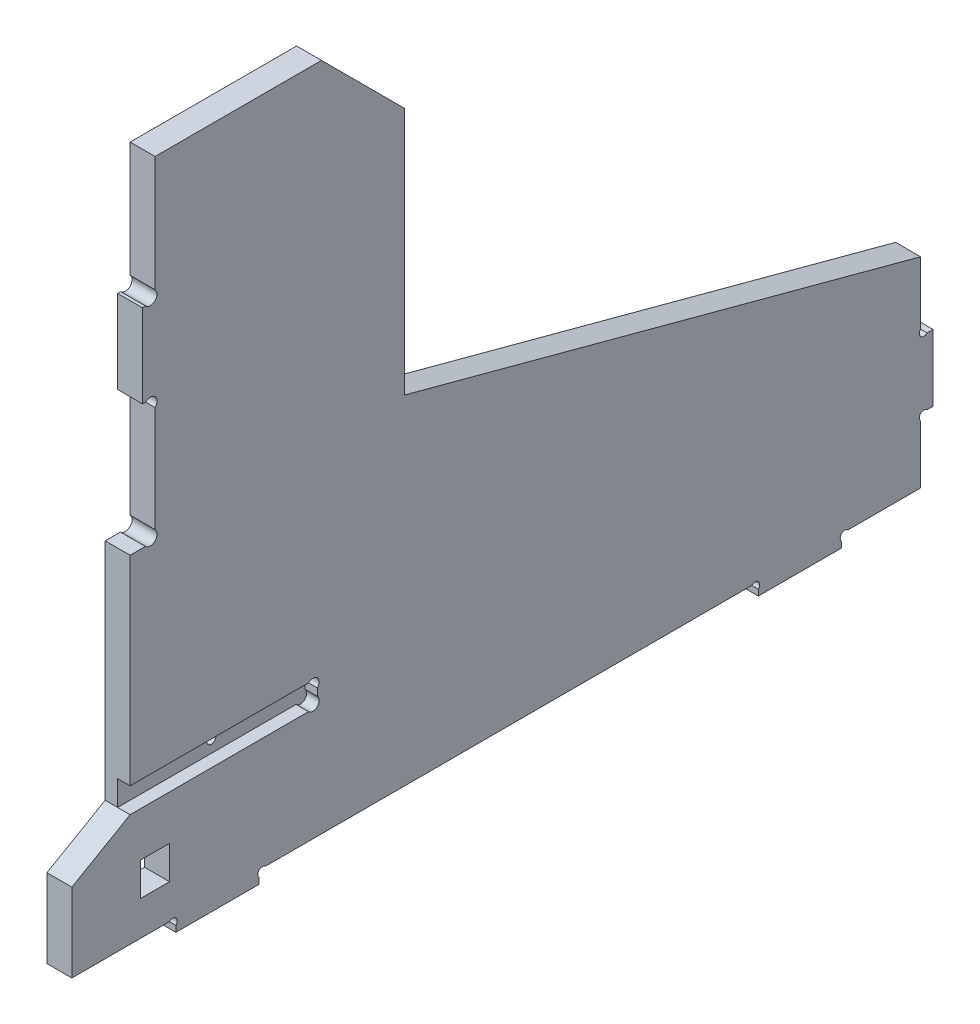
ISO-10303-21;
HEADER;
FILE_DESCRIPTION(('STEP AP214'),'2;1');
FILE_NAME('part.step','',(''),(''),'','','');
FILE_SCHEMA(('AUTOMOTIVE_DESIGN { 1 0 10303 214 1 1 1 1 }'));
ENDSEC;
DATA;
#1=APPLICATION_CONTEXT('core data for automotive mechanical design processes');
#2=APPLICATION_PROTOCOL_DEFINITION('international standard','automotive_design',2000,#1);
#3=PRODUCT_CONTEXT('',#1,'mechanical');
#4=PRODUCT('Part','Part','',(#3));
#5=PRODUCT_RELATED_PRODUCT_CATEGORY('part','',(#4));
#6=PRODUCT_DEFINITION_FORMATION('','',#4);
#7=PRODUCT_DEFINITION_CONTEXT('part definition',#1,'design');
#8=PRODUCT_DEFINITION('design','',#6,#7);
#9=PRODUCT_DEFINITION_SHAPE('','',#8);
#10=(LENGTH_UNIT() NAMED_UNIT(*) SI_UNIT(.MILLI.,.METRE.));
#11=(NAMED_UNIT(*) PLANE_ANGLE_UNIT() SI_UNIT($,.RADIAN.));
#12=(NAMED_UNIT(*) SI_UNIT($,.STERADIAN.) SOLID_ANGLE_UNIT());
#13=UNCERTAINTY_MEASURE_WITH_UNIT(LENGTH_MEASURE(1.E-05),#10,'distance_accuracy_value','');
#14=(GEOMETRIC_REPRESENTATION_CONTEXT(3) GLOBAL_UNCERTAINTY_ASSIGNED_CONTEXT((#13)) GLOBAL_UNIT_ASSIGNED_CONTEXT((#10,
#11,#12)) REPRESENTATION_CONTEXT('',''));
#15=CARTESIAN_POINT('',(0.,0.,0.));
#16=DIRECTION('',(0.,0.,1.));
#17=DIRECTION('',(1.,0.,0.));
#18=AXIS2_PLACEMENT_3D('',#15,#16,#17);
#19=CARTESIAN_POINT('',(6.,33.,-36.5));
#20=DIRECTION('',(-1.,0.,0.));
#21=DIRECTION('',(0.,0.,1.));
#22=AXIS2_PLACEMENT_3D('',#19,#20,#21);
#23=CYLINDRICAL_SURFACE('',#22,1.1);
#24=CARTESIAN_POINT('',(0.,33.,-36.5));
#25=DIRECTION('',(1.,0.,0.));
#26=DIRECTION('',(0.,0.,-1.));
#27=AXIS2_PLACEMENT_3D('',#24,#25,#26);
#28=CIRCLE('',#27,1.1);
#29=CARTESIAN_POINT('',(0.,33.,-37.6));
#30=VERTEX_POINT('',#29);
#31=EDGE_CURVE('E402',#30,#30,#28,.T.);
#32=ORIENTED_EDGE('',*,*,#31,.F.);
#33=EDGE_LOOP('',(#32));
#34=FACE_BOUND('',#33,.T.);
#35=CARTESIAN_POINT('',(3.,33.,-36.5));
#36=DIRECTION('',(1.,0.,0.));
#37=DIRECTION('',(0.,0.,-1.));
#38=AXIS2_PLACEMENT_3D('',#35,#36,#37);
#39=CIRCLE('',#38,1.1);
#40=CARTESIAN_POINT('',(3.,33.,-37.6));
#41=VERTEX_POINT('',#40);
#42=EDGE_CURVE('E37',#41,#41,#39,.T.);
#43=ORIENTED_EDGE('',*,*,#42,.T.);
#44=EDGE_LOOP('',(#43));
#45=FACE_BOUND('',#44,.T.);
#46=ADVANCED_FACE('F33',(#34,#45),#23,.F.);
#47=CARTESIAN_POINT('',(6.,35.2778174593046,-204.777817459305));
#48=DIRECTION('',(-1.,0.,0.));
#49=DIRECTION('',(0.,0.,1.));
#50=AXIS2_PLACEMENT_3D('',#47,#48,#49);
#51=PLANE('',#50);
#52=CARTESIAN_POINT('',(6.,31.0606601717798,-57.9393398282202));
#53=DIRECTION('',(1.,0.,0.));
#54=DIRECTION('',(0.,0.,-1.));
#55=AXIS2_PLACEMENT_3D('',#52,#53,#54);
#56=CIRCLE('',#55,1.5);
#57=CARTESIAN_POINT('',(6.,30.,-56.8786796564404));
#58=VERTEX_POINT('',#57);
#59=CARTESIAN_POINT('',(6.,32.1213203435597,-59.));
#60=VERTEX_POINT('',#59);
#61=EDGE_CURVE('E330',#58,#60,#56,.T.);
#62=ORIENTED_EDGE('',*,*,#61,.F.);
#63=DIRECTION('',(0.,0.,-1.));
#64=VECTOR('',#63,1.);
#65=CARTESIAN_POINT('',(6.,30.,-14.));
#66=LINE('',#65,#64);
#67=CARTESIAN_POINT('',(6.,30.,-14.));
#68=VERTEX_POINT('',#67);
#69=EDGE_CURVE('E345',#68,#58,#66,.T.);
#70=ORIENTED_EDGE('',*,*,#69,.F.);
#71=DIRECTION('',(0.,-0.500000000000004,0.866025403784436));
#72=VECTOR('',#71,1.);
#73=CARTESIAN_POINT('',(6.,30.,-14.));
#74=LINE('',#73,#72);
#75=CARTESIAN_POINT('',(6.,21.9170962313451,0.));
#76=VERTEX_POINT('',#75);
#77=EDGE_CURVE('E431',#68,#76,#74,.T.);
#78=ORIENTED_EDGE('',*,*,#77,.T.);
#79=DIRECTION('',(0.,-1.,0.));
#80=VECTOR('',#79,1.);
#81=CARTESIAN_POINT('',(6.,21.9170962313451,0.));
#82=LINE('',#81,#80);
#83=CARTESIAN_POINT('',(6.,3.,0.));
#84=VERTEX_POINT('',#83);
#85=EDGE_CURVE('E433',#76,#84,#82,.T.);
#86=ORIENTED_EDGE('',*,*,#85,.T.);
#87=DIRECTION('',(0.,0.,-1.));
#88=VECTOR('',#87,1.);
#89=CARTESIAN_POINT('',(6.,3.,0.));
#90=LINE('',#89,#88);
#91=CARTESIAN_POINT('',(6.,3.00000000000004,-23.4443650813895));
#92=VERTEX_POINT('',#91);
#93=EDGE_CURVE('E435',#84,#92,#90,.T.);
#94=ORIENTED_EDGE('',*,*,#93,.T.);
#95=CARTESIAN_POINT('',(6.,2.22218254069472,-24.2221825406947));
#96=DIRECTION('',(-1.,0.,0.));
#97=DIRECTION('',(0.,0.,1.));
#98=AXIS2_PLACEMENT_3D('',#95,#96,#97);
#99=CIRCLE('',#98,1.10000000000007);
#100=CARTESIAN_POINT('',(6.,1.44436508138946,-25.));
#101=VERTEX_POINT('',#100);
#102=EDGE_CURVE('E437',#92,#101,#99,.T.);
#103=ORIENTED_EDGE('',*,*,#102,.T.);
#104=DIRECTION('',(0.,-1.,0.));
#105=VECTOR('',#104,1.);
#106=CARTESIAN_POINT('',(6.,1.44436508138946,-25.));
#107=LINE('',#106,#105);
#108=CARTESIAN_POINT('',(6.,0.,-25.));
#109=VERTEX_POINT('',#108);
#110=EDGE_CURVE('E439',#101,#109,#107,.T.);
#111=ORIENTED_EDGE('',*,*,#110,.T.);
#112=DIRECTION('',(0.,0.,-1.));
#113=VECTOR('',#112,1.);
#114=CARTESIAN_POINT('',(6.,0.,-25.));
#115=LINE('',#114,#113);
#116=CARTESIAN_POINT('',(6.,0.,-45.));
#117=VERTEX_POINT('',#116);
#118=EDGE_CURVE('E441',#109,#117,#115,.T.);
#119=ORIENTED_EDGE('',*,*,#118,.T.);
#120=DIRECTION('',(0.,1.,0.));
#121=VECTOR('',#120,1.);
#122=CARTESIAN_POINT('',(6.,0.,-45.));
#123=LINE('',#122,#121);
#124=CARTESIAN_POINT('',(6.,1.44436508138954,-45.));
#125=VERTEX_POINT('',#124);
#126=EDGE_CURVE('E443',#117,#125,#123,.T.);
#127=ORIENTED_EDGE('',*,*,#126,.T.);
#128=CARTESIAN_POINT('',(6.,2.22218254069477,-45.7778174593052));
#129=DIRECTION('',(-1.,0.,0.));
#130=DIRECTION('',(0.,0.,-1.));
#131=AXIS2_PLACEMENT_3D('',#128,#129,#130);
#132=CIRCLE('',#131,1.10000000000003);
#133=CARTESIAN_POINT('',(6.,3.,-46.5556349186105));
#134=VERTEX_POINT('',#133);
#135=EDGE_CURVE('E445',#125,#134,#132,.T.);
#136=ORIENTED_EDGE('',*,*,#135,.T.);
#137=DIRECTION('',(0.,0.,-1.));
#138=VECTOR('',#137,1.);
#139=CARTESIAN_POINT('',(6.,3.,-46.5556349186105));
#140=LINE('',#139,#138);
#141=CARTESIAN_POINT('',(6.,3.,-163.44436508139));
#142=VERTEX_POINT('',#141);
#143=EDGE_CURVE('E447',#134,#142,#140,.T.);
#144=ORIENTED_EDGE('',*,*,#143,.T.);
#145=CARTESIAN_POINT('',(6.,2.22218254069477,-164.222182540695));
#146=DIRECTION('',(-1.,0.,0.));
#147=DIRECTION('',(0.,0.,1.));
#148=AXIS2_PLACEMENT_3D('',#145,#146,#147);
#149=CIRCLE('',#148,1.10000000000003);
#150=CARTESIAN_POINT('',(6.,1.44436508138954,-165.));
#151=VERTEX_POINT('',#150);
#152=EDGE_CURVE('E449',#142,#151,#149,.T.);
#153=ORIENTED_EDGE('',*,*,#152,.T.);
#154=DIRECTION('',(0.,-1.,0.));
#155=VECTOR('',#154,1.);
#156=CARTESIAN_POINT('',(6.,0.,-165.));
#157=LINE('',#156,#155);
#158=CARTESIAN_POINT('',(6.,0.,-165.));
#159=VERTEX_POINT('',#158);
#160=EDGE_CURVE('E451',#151,#159,#157,.T.);
#161=ORIENTED_EDGE('',*,*,#160,.T.);
#162=DIRECTION('',(0.,0.,-1.));
#163=VECTOR('',#162,1.);
#164=CARTESIAN_POINT('',(6.,0.,-185.));
#165=LINE('',#164,#163);
#166=CARTESIAN_POINT('',(6.,0.,-185.));
#167=VERTEX_POINT('',#166);
#168=EDGE_CURVE('E453',#159,#167,#165,.T.);
#169=ORIENTED_EDGE('',*,*,#168,.T.);
#170=DIRECTION('',(0.,1.,0.));
#171=VECTOR('',#170,1.);
#172=CARTESIAN_POINT('',(6.,1.44436508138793,-185.));
#173=LINE('',#172,#171);
#174=CARTESIAN_POINT('',(6.,1.44436508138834,-185.));
#175=VERTEX_POINT('',#174);
#176=EDGE_CURVE('E455',#167,#175,#173,.T.);
#177=ORIENTED_EDGE('',*,*,#176,.T.);
#178=CARTESIAN_POINT('',(6.,2.22218254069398,-185.777817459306));
#179=DIRECTION('',(-1.,0.,0.));
#180=DIRECTION('',(0.,0.,-1.));
#181=AXIS2_PLACEMENT_3D('',#178,#179,#180);
#182=CIRCLE('',#181,1.10000000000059);
#183=CARTESIAN_POINT('',(6.,3.,-186.55563491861));
#184=VERTEX_POINT('',#183);
#185=EDGE_CURVE('E457',#175,#184,#182,.T.);
#186=ORIENTED_EDGE('',*,*,#185,.T.);
#187=DIRECTION('',(0.,0.,-1.));
#188=VECTOR('',#187,1.);
#189=CARTESIAN_POINT('',(6.,3.,-186.55563491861));
#190=LINE('',#189,#188);
#191=CARTESIAN_POINT('',(6.,3.,-204.));
#192=VERTEX_POINT('',#191);
#193=EDGE_CURVE('E459',#184,#192,#190,.T.);
#194=ORIENTED_EDGE('',*,*,#193,.T.);
#195=DIRECTION('',(0.,1.,0.));
#196=VECTOR('',#195,1.);
#197=CARTESIAN_POINT('',(6.,16.9443650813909,-204.));
#198=LINE('',#197,#196);
#199=CARTESIAN_POINT('',(6.,16.9443650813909,-204.));
#200=VERTEX_POINT('',#199);
#201=EDGE_CURVE('E461',#192,#200,#198,.T.);
#202=ORIENTED_EDGE('',*,*,#201,.T.);
#203=CARTESIAN_POINT('',(6.,17.7221825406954,-204.777817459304));
#204=DIRECTION('',(-1.,0.,0.));
#205=DIRECTION('',(0.,0.,-1.));
#206=AXIS2_PLACEMENT_3D('',#203,#204,#205);
#207=CIRCLE('',#206,1.09999999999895);
#208=CARTESIAN_POINT('',(6.,18.4999999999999,-205.555634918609));
#209=VERTEX_POINT('',#208);
#210=EDGE_CURVE('E463',#200,#209,#207,.T.);
#211=ORIENTED_EDGE('',*,*,#210,.T.);
#212=DIRECTION('',(0.,0.,-1.));
#213=VECTOR('',#212,1.);
#214=CARTESIAN_POINT('',(6.,18.4999999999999,-205.555634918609));
#215=LINE('',#214,#213);
#216=CARTESIAN_POINT('',(6.,18.4999999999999,-207.));
#217=VERTEX_POINT('',#216);
#218=EDGE_CURVE('E465',#209,#217,#215,.T.);
#219=ORIENTED_EDGE('',*,*,#218,.T.);
#220=DIRECTION('',(0.,1.,0.));
#221=VECTOR('',#220,1.);
#222=CARTESIAN_POINT('',(6.,34.4999999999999,-207.));
#223=LINE('',#222,#221);
#224=CARTESIAN_POINT('',(6.,34.4999999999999,-207.));
#225=VERTEX_POINT('',#224);
#226=EDGE_CURVE('E467',#217,#225,#223,.T.);
#227=ORIENTED_EDGE('',*,*,#226,.T.);
#228=DIRECTION('',(0.,0.,1.));
#229=VECTOR('',#228,1.);
#230=CARTESIAN_POINT('',(6.,34.4999999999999,-205.555634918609));
#231=LINE('',#230,#229);
#232=CARTESIAN_POINT('',(6.,34.4999999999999,-205.555634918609));
#233=VERTEX_POINT('',#232);
#234=EDGE_CURVE('E469',#225,#233,#231,.T.);
#235=ORIENTED_EDGE('',*,*,#234,.T.);
#236=CARTESIAN_POINT('',(6.,35.2778174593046,-204.777817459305));
#237=DIRECTION('',(-1.,0.,0.));
#238=DIRECTION('',(0.,0.,1.));
#239=AXIS2_PLACEMENT_3D('',#236,#237,#238);
#240=CIRCLE('',#239,1.09999999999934);
#241=CARTESIAN_POINT('',(6.,36.0556349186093,-204.));
#242=VERTEX_POINT('',#241);
#243=EDGE_CURVE('E471',#233,#242,#240,.T.);
#244=ORIENTED_EDGE('',*,*,#243,.T.);
#245=DIRECTION('',(0.,1.,0.));
#246=VECTOR('',#245,1.);
#247=CARTESIAN_POINT('',(6.,36.0556349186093,-204.));
#248=LINE('',#247,#246);
#249=CARTESIAN_POINT('',(6.,51.13,-204.));
#250=VERTEX_POINT('',#249);
#251=EDGE_CURVE('E473',#242,#250,#248,.T.);
#252=ORIENTED_EDGE('',*,*,#251,.T.);
#253=DIRECTION('',(0.,0.258819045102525,0.965925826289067));
#254=VECTOR('',#253,1.);
#255=CARTESIAN_POINT('',(6.,51.13,-204.));
#256=LINE('',#255,#254);
#257=CARTESIAN_POINT('',(6.,84.3556998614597,-80.));
#258=VERTEX_POINT('',#257);
#259=EDGE_CURVE('E475',#250,#258,#256,.T.);
#260=ORIENTED_EDGE('',*,*,#259,.T.);
#261=DIRECTION('',(0.,1.,0.));
#262=VECTOR('',#261,1.);
#263=CARTESIAN_POINT('',(6.,144.,-80.));
#264=LINE('',#263,#262);
#265=CARTESIAN_POINT('',(6.,144.,-80.));
#266=VERTEX_POINT('',#265);
#267=EDGE_CURVE('E477',#258,#266,#264,.T.);
#268=ORIENTED_EDGE('',*,*,#267,.T.);
#269=DIRECTION('',(0.,0.707106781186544,0.707106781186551));
#270=VECTOR('',#269,1.);
#271=CARTESIAN_POINT('',(6.,164.,-60.));
#272=LINE('',#271,#270);
#273=CARTESIAN_POINT('',(6.,164.,-60.));
#274=VERTEX_POINT('',#273);
#275=EDGE_CURVE('E479',#266,#274,#272,.T.);
#276=ORIENTED_EDGE('',*,*,#275,.T.);
#277=DIRECTION('',(0.,0.,1.));
#278=VECTOR('',#277,1.);
#279=CARTESIAN_POINT('',(6.,164.,-19.9999999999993));
#280=LINE('',#279,#278);
#281=CARTESIAN_POINT('',(6.,164.,-19.9999999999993));
#282=VERTEX_POINT('',#281);
#283=EDGE_CURVE('E406',#274,#282,#280,.T.);
#284=ORIENTED_EDGE('',*,*,#283,.T.);
#285=DIRECTION('',(0.,-1.,0.));
#286=VECTOR('',#285,1.);
#287=CARTESIAN_POINT('',(6.,164.,-19.9999999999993));
#288=LINE('',#287,#286);
#289=CARTESIAN_POINT('',(6.,136.262741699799,-19.9999999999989));
#290=VERTEX_POINT('',#289);
#291=EDGE_CURVE('E409',#282,#290,#288,.T.);
#292=ORIENTED_EDGE('',*,*,#291,.T.);
#293=CARTESIAN_POINT('',(6.,135.131370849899,-18.8686291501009));
#294=DIRECTION('',(-1.,0.,0.));
#295=DIRECTION('',(0.,0.,-1.));
#296=AXIS2_PLACEMENT_3D('',#293,#294,#295);
#297=CIRCLE('',#296,1.60000000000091);
#298=CARTESIAN_POINT('',(6.,134.,-17.7372583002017));
#299=VERTEX_POINT('',#298);
#300=EDGE_CURVE('E412',#290,#299,#297,.T.);
#301=ORIENTED_EDGE('',*,*,#300,.T.);
#302=DIRECTION('',(0.,0.,1.));
#303=VECTOR('',#302,1.);
#304=CARTESIAN_POINT('',(6.,134.,-17.7372583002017));
#305=LINE('',#304,#303);
#306=CARTESIAN_POINT('',(6.,134.,-17.));
#307=VERTEX_POINT('',#306);
#308=EDGE_CURVE('E414',#299,#307,#305,.T.);
#309=ORIENTED_EDGE('',*,*,#308,.T.);
#310=DIRECTION('',(0.,-1.,0.));
#311=VECTOR('',#310,1.);
#312=CARTESIAN_POINT('',(6.,134.,-17.));
#313=LINE('',#312,#311);
#314=CARTESIAN_POINT('',(6.,114.,-17.));
#315=VERTEX_POINT('',#314);
#316=EDGE_CURVE('E416',#307,#315,#313,.T.);
#317=ORIENTED_EDGE('',*,*,#316,.T.);
#318=DIRECTION('',(0.,0.,-1.));
#319=VECTOR('',#318,1.);
#320=CARTESIAN_POINT('',(6.,114.,-17.));
#321=LINE('',#320,#319);
#322=CARTESIAN_POINT('',(6.,114.,-17.7372583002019));
#323=VERTEX_POINT('',#322);
#324=EDGE_CURVE('E418',#315,#323,#321,.T.);
#325=ORIENTED_EDGE('',*,*,#324,.T.);
#326=CARTESIAN_POINT('',(6.,112.868629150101,-18.8686291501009));
#327=DIRECTION('',(-1.,0.,0.));
#328=DIRECTION('',(0.,0.,1.));
#329=AXIS2_PLACEMENT_3D('',#326,#327,#328);
#330=CIRCLE('',#329,1.60000000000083);
#331=CARTESIAN_POINT('',(6.,111.737258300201,-19.9999999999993));
#332=VERTEX_POINT('',#331);
#333=EDGE_CURVE('E420',#323,#332,#330,.T.);
#334=ORIENTED_EDGE('',*,*,#333,.T.);
#335=DIRECTION('',(0.,-1.,0.));
#336=VECTOR('',#335,1.);
#337=CARTESIAN_POINT('',(6.,111.737258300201,-19.9999999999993));
#338=LINE('',#337,#336);
#339=CARTESIAN_POINT('',(6.,86.3334523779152,-20.));
#340=VERTEX_POINT('',#339);
#341=EDGE_CURVE('E422',#332,#340,#338,.T.);
#342=ORIENTED_EDGE('',*,*,#341,.T.);
#343=CARTESIAN_POINT('',(6.,85.1667261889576,-18.8332738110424));
#344=DIRECTION('',(-1.,0.,0.));
#345=DIRECTION('',(0.,0.,-1.));
#346=AXIS2_PLACEMENT_3D('',#343,#344,#345);
#347=CIRCLE('',#346,1.64999999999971);
#348=CARTESIAN_POINT('',(6.,84.,-17.6665476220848));
#349=VERTEX_POINT('',#348);
#350=EDGE_CURVE('E424',#340,#349,#347,.T.);
#351=ORIENTED_EDGE('',*,*,#350,.T.);
#352=DIRECTION('',(0.,0.,1.));
#353=VECTOR('',#352,1.);
#354=CARTESIAN_POINT('',(6.,84.,-14.));
#355=LINE('',#354,#353);
#356=CARTESIAN_POINT('',(6.,84.,-14.));
#357=VERTEX_POINT('',#356);
#358=EDGE_CURVE('E426',#349,#357,#355,.T.);
#359=ORIENTED_EDGE('',*,*,#358,.T.);
#360=DIRECTION('',(0.,-1.,0.));
#361=VECTOR('',#360,1.);
#362=CARTESIAN_POINT('',(6.,30.,-14.));
#363=LINE('',#362,#361);
#364=CARTESIAN_POINT('',(6.,36.,-14.));
#365=VERTEX_POINT('',#364);
#366=EDGE_CURVE('E428',#357,#365,#363,.T.);
#367=ORIENTED_EDGE('',*,*,#366,.T.);
#368=DIRECTION('',(0.,0.,1.));
#369=VECTOR('',#368,1.);
#370=CARTESIAN_POINT('',(6.,36.,-14.));
#371=LINE('',#370,#369);
#372=CARTESIAN_POINT('',(6.,36.,-56.8786796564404));
#373=VERTEX_POINT('',#372);
#374=EDGE_CURVE('E348',#373,#365,#371,.T.);
#375=ORIENTED_EDGE('',*,*,#374,.F.);
#376=CARTESIAN_POINT('',(6.,34.9393398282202,-57.9393398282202));
#377=DIRECTION('',(1.,0.,0.));
#378=DIRECTION('',(0.,0.,1.));
#379=AXIS2_PLACEMENT_3D('',#376,#377,#378);
#380=CIRCLE('',#379,1.5);
#381=CARTESIAN_POINT('',(6.,33.8786796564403,-59.));
#382=VERTEX_POINT('',#381);
#383=EDGE_CURVE('E361',#382,#373,#380,.T.);
#384=ORIENTED_EDGE('',*,*,#383,.F.);
#385=DIRECTION('',(0.,1.,0.));
#386=VECTOR('',#385,1.);
#387=CARTESIAN_POINT('',(6.,33.8786796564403,-59.));
#388=LINE('',#387,#386);
#389=EDGE_CURVE('E359',#60,#382,#388,.T.);
#390=ORIENTED_EDGE('',*,*,#389,.F.);
#391=EDGE_LOOP('',(#62,#70,#78,#86,#94,#103,#111,#119,#127,#136,#144,#153,#161,#169,#177,#186,
#194,#202,#211,#219,#227,#235,#244,#252,#260,#268,#276,#284,#292,#301,#309,#317,#325,#334,#342,
#351,#359,#367,#375,#384,#390));
#392=FACE_BOUND('',#391,.T.);
#393=DIRECTION('',(0.,-1.,0.));
#394=VECTOR('',#393,1.);
#395=CARTESIAN_POINT('',(6.,19.3,-16.48));
#396=LINE('',#395,#394);
#397=CARTESIAN_POINT('',(6.,19.3,-16.48));
#398=VERTEX_POINT('',#397);
#399=CARTESIAN_POINT('',(6.,11.3,-16.48));
#400=VERTEX_POINT('',#399);
#401=EDGE_CURVE('E373',#398,#400,#396,.T.);
#402=ORIENTED_EDGE('',*,*,#401,.F.);
#403=DIRECTION('',(0.,0.,1.));
#404=VECTOR('',#403,1.);
#405=CARTESIAN_POINT('',(6.,19.3,-16.48));
#406=LINE('',#405,#404);
#407=CARTESIAN_POINT('',(6.,19.3,-23.48));
#408=VERTEX_POINT('',#407);
#409=EDGE_CURVE('E380',#408,#398,#406,.T.);
#410=ORIENTED_EDGE('',*,*,#409,.F.);
#411=DIRECTION('',(0.,1.,0.));
#412=VECTOR('',#411,1.);
#413=CARTESIAN_POINT('',(6.,19.3,-23.48));
#414=LINE('',#413,#412);
#415=CARTESIAN_POINT('',(6.,11.3,-23.48));
#416=VERTEX_POINT('',#415);
#417=EDGE_CURVE('E378',#416,#408,#414,.T.);
#418=ORIENTED_EDGE('',*,*,#417,.F.);
#419=DIRECTION('',(0.,0.,-1.));
#420=VECTOR('',#419,1.);
#421=CARTESIAN_POINT('',(6.,11.3,-16.48));
#422=LINE('',#421,#420);
#423=EDGE_CURVE('E375',#400,#416,#422,.T.);
#424=ORIENTED_EDGE('',*,*,#423,.F.);
#425=EDGE_LOOP('',(#402,#410,#418,#424));
#426=FACE_BOUND('',#425,.T.);
#427=ADVANCED_FACE('F681',(#392,#426),#51,.F.);
#428=CARTESIAN_POINT('',(0.,35.2778174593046,-204.777817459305));
#429=DIRECTION('',(-1.,0.,0.));
#430=DIRECTION('',(0.,0.,1.));
#431=AXIS2_PLACEMENT_3D('',#428,#429,#430);
#432=PLANE('',#431);
#433=DIRECTION('',(0.,0.,1.));
#434=VECTOR('',#433,1.);
#435=CARTESIAN_POINT('',(0.,164.,-19.9999999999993));
#436=LINE('',#435,#434);
#437=CARTESIAN_POINT('',(0.,164.,-60.));
#438=VERTEX_POINT('',#437);
#439=CARTESIAN_POINT('',(0.,164.,-19.9999999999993));
#440=VERTEX_POINT('',#439);
#441=EDGE_CURVE('E405',#438,#440,#436,.T.);
#442=ORIENTED_EDGE('',*,*,#441,.F.);
#443=DIRECTION('',(0.,0.707106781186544,0.707106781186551));
#444=VECTOR('',#443,1.);
#445=CARTESIAN_POINT('',(0.,164.,-60.));
#446=LINE('',#445,#444);
#447=CARTESIAN_POINT('',(0.,144.,-80.));
#448=VERTEX_POINT('',#447);
#449=EDGE_CURVE('E410',#448,#438,#446,.T.);
#450=ORIENTED_EDGE('',*,*,#449,.F.);
#451=DIRECTION('',(0.,1.,0.));
#452=VECTOR('',#451,1.);
#453=CARTESIAN_POINT('',(0.,144.,-80.));
#454=LINE('',#453,#452);
#455=CARTESIAN_POINT('',(0.,84.3556998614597,-80.));
#456=VERTEX_POINT('',#455);
#457=EDGE_CURVE('E551',#456,#448,#454,.T.);
#458=ORIENTED_EDGE('',*,*,#457,.F.);
#459=DIRECTION('',(0.,0.258819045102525,0.965925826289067));
#460=VECTOR('',#459,1.);
#461=CARTESIAN_POINT('',(0.,51.13,-204.));
#462=LINE('',#461,#460);
#463=CARTESIAN_POINT('',(0.,51.13,-204.));
#464=VERTEX_POINT('',#463);
#465=EDGE_CURVE('E549',#464,#456,#462,.T.);
#466=ORIENTED_EDGE('',*,*,#465,.F.);
#467=DIRECTION('',(0.,1.,0.));
#468=VECTOR('',#467,1.);
#469=CARTESIAN_POINT('',(0.,36.0556349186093,-204.));
#470=LINE('',#469,#468);
#471=CARTESIAN_POINT('',(0.,36.0556349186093,-204.));
#472=VERTEX_POINT('',#471);
#473=EDGE_CURVE('E547',#472,#464,#470,.T.);
#474=ORIENTED_EDGE('',*,*,#473,.F.);
#475=CARTESIAN_POINT('',(0.,35.2778174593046,-204.777817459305));
#476=DIRECTION('',(-1.,0.,0.));
#477=DIRECTION('',(0.,0.,1.));
#478=AXIS2_PLACEMENT_3D('',#475,#476,#477);
#479=CIRCLE('',#478,1.09999999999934);
#480=CARTESIAN_POINT('',(0.,34.4999999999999,-205.555634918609));
#481=VERTEX_POINT('',#480);
#482=EDGE_CURVE('E545',#481,#472,#479,.T.);
#483=ORIENTED_EDGE('',*,*,#482,.F.);
#484=DIRECTION('',(0.,0.,1.));
#485=VECTOR('',#484,1.);
#486=CARTESIAN_POINT('',(0.,34.4999999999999,-205.555634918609));
#487=LINE('',#486,#485);
#488=CARTESIAN_POINT('',(0.,34.4999999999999,-207.));
#489=VERTEX_POINT('',#488);
#490=EDGE_CURVE('E543',#489,#481,#487,.T.);
#491=ORIENTED_EDGE('',*,*,#490,.F.);
#492=DIRECTION('',(0.,1.,0.));
#493=VECTOR('',#492,1.);
#494=CARTESIAN_POINT('',(0.,34.4999999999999,-207.));
#495=LINE('',#494,#493);
#496=CARTESIAN_POINT('',(0.,18.4999999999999,-207.));
#497=VERTEX_POINT('',#496);
#498=EDGE_CURVE('E541',#497,#489,#495,.T.);
#499=ORIENTED_EDGE('',*,*,#498,.F.);
#500=DIRECTION('',(0.,0.,-1.));
#501=VECTOR('',#500,1.);
#502=CARTESIAN_POINT('',(0.,18.4999999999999,-205.555634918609));
#503=LINE('',#502,#501);
#504=CARTESIAN_POINT('',(0.,18.4999999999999,-205.555634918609));
#505=VERTEX_POINT('',#504);
#506=EDGE_CURVE('E539',#505,#497,#503,.T.);
#507=ORIENTED_EDGE('',*,*,#506,.F.);
#508=CARTESIAN_POINT('',(0.,17.7221825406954,-204.777817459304));
#509=DIRECTION('',(-1.,0.,0.));
#510=DIRECTION('',(0.,0.,-1.));
#511=AXIS2_PLACEMENT_3D('',#508,#509,#510);
#512=CIRCLE('',#511,1.09999999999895);
#513=CARTESIAN_POINT('',(0.,16.9443650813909,-204.));
#514=VERTEX_POINT('',#513);
#515=EDGE_CURVE('E537',#514,#505,#512,.T.);
#516=ORIENTED_EDGE('',*,*,#515,.F.);
#517=DIRECTION('',(0.,1.,0.));
#518=VECTOR('',#517,1.);
#519=CARTESIAN_POINT('',(0.,16.9443650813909,-204.));
#520=LINE('',#519,#518);
#521=CARTESIAN_POINT('',(0.,3.,-204.));
#522=VERTEX_POINT('',#521);
#523=EDGE_CURVE('E535',#522,#514,#520,.T.);
#524=ORIENTED_EDGE('',*,*,#523,.F.);
#525=DIRECTION('',(0.,0.,-1.));
#526=VECTOR('',#525,1.);
#527=CARTESIAN_POINT('',(0.,3.,-186.55563491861));
#528=LINE('',#527,#526);
#529=CARTESIAN_POINT('',(0.,3.,-186.55563491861));
#530=VERTEX_POINT('',#529);
#531=EDGE_CURVE('E533',#530,#522,#528,.T.);
#532=ORIENTED_EDGE('',*,*,#531,.F.);
#533=CARTESIAN_POINT('',(0.,2.22218254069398,-185.777817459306));
#534=DIRECTION('',(-1.,0.,0.));
#535=DIRECTION('',(0.,0.,-1.));
#536=AXIS2_PLACEMENT_3D('',#533,#534,#535);
#537=CIRCLE('',#536,1.10000000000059);
#538=CARTESIAN_POINT('',(0.,1.44436508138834,-185.));
#539=VERTEX_POINT('',#538);
#540=EDGE_CURVE('E531',#539,#530,#537,.T.);
#541=ORIENTED_EDGE('',*,*,#540,.F.);
#542=DIRECTION('',(0.,1.,0.));
#543=VECTOR('',#542,1.);
#544=CARTESIAN_POINT('',(0.,1.44436508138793,-185.));
#545=LINE('',#544,#543);
#546=CARTESIAN_POINT('',(0.,0.,-185.));
#547=VERTEX_POINT('',#546);
#548=EDGE_CURVE('E529',#547,#539,#545,.T.);
#549=ORIENTED_EDGE('',*,*,#548,.F.);
#550=DIRECTION('',(0.,0.,-1.));
#551=VECTOR('',#550,1.);
#552=CARTESIAN_POINT('',(0.,0.,-185.));
#553=LINE('',#552,#551);
#554=CARTESIAN_POINT('',(0.,0.,-165.));
#555=VERTEX_POINT('',#554);
#556=EDGE_CURVE('E527',#555,#547,#553,.T.);
#557=ORIENTED_EDGE('',*,*,#556,.F.);
#558=DIRECTION('',(0.,-1.,0.));
#559=VECTOR('',#558,1.);
#560=CARTESIAN_POINT('',(0.,0.,-165.));
#561=LINE('',#560,#559);
#562=CARTESIAN_POINT('',(0.,1.44436508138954,-165.));
#563=VERTEX_POINT('',#562);
#564=EDGE_CURVE('E525',#563,#555,#561,.T.);
#565=ORIENTED_EDGE('',*,*,#564,.F.);
#566=CARTESIAN_POINT('',(0.,2.22218254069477,-164.222182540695));
#567=DIRECTION('',(-1.,0.,0.));
#568=DIRECTION('',(0.,0.,1.));
#569=AXIS2_PLACEMENT_3D('',#566,#567,#568);
#570=CIRCLE('',#569,1.10000000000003);
#571=CARTESIAN_POINT('',(0.,3.,-163.44436508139));
#572=VERTEX_POINT('',#571);
#573=EDGE_CURVE('E523',#572,#563,#570,.T.);
#574=ORIENTED_EDGE('',*,*,#573,.F.);
#575=DIRECTION('',(0.,0.,-1.));
#576=VECTOR('',#575,1.);
#577=CARTESIAN_POINT('',(0.,3.,-46.5556349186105));
#578=LINE('',#577,#576);
#579=CARTESIAN_POINT('',(0.,3.,-46.5556349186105));
#580=VERTEX_POINT('',#579);
#581=EDGE_CURVE('E521',#580,#572,#578,.T.);
#582=ORIENTED_EDGE('',*,*,#581,.F.);
#583=CARTESIAN_POINT('',(0.,2.22218254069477,-45.7778174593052));
#584=DIRECTION('',(-1.,0.,0.));
#585=DIRECTION('',(0.,0.,-1.));
#586=AXIS2_PLACEMENT_3D('',#583,#584,#585);
#587=CIRCLE('',#586,1.10000000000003);
#588=CARTESIAN_POINT('',(0.,1.44436508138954,-45.));
#589=VERTEX_POINT('',#588);
#590=EDGE_CURVE('E519',#589,#580,#587,.T.);
#591=ORIENTED_EDGE('',*,*,#590,.F.);
#592=DIRECTION('',(0.,1.,0.));
#593=VECTOR('',#592,1.);
#594=CARTESIAN_POINT('',(0.,0.,-45.));
#595=LINE('',#594,#593);
#596=CARTESIAN_POINT('',(0.,0.,-45.));
#597=VERTEX_POINT('',#596);
#598=EDGE_CURVE('E517',#597,#589,#595,.T.);
#599=ORIENTED_EDGE('',*,*,#598,.F.);
#600=DIRECTION('',(0.,0.,-1.));
#601=VECTOR('',#600,1.);
#602=CARTESIAN_POINT('',(0.,0.,-25.));
#603=LINE('',#602,#601);
#604=CARTESIAN_POINT('',(0.,0.,-25.));
#605=VERTEX_POINT('',#604);
#606=EDGE_CURVE('E515',#605,#597,#603,.T.);
#607=ORIENTED_EDGE('',*,*,#606,.F.);
#608=DIRECTION('',(0.,-1.,0.));
#609=VECTOR('',#608,1.);
#610=CARTESIAN_POINT('',(0.,1.44436508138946,-25.));
#611=LINE('',#610,#609);
#612=CARTESIAN_POINT('',(0.,1.44436508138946,-25.));
#613=VERTEX_POINT('',#612);
#614=EDGE_CURVE('E513',#613,#605,#611,.T.);
#615=ORIENTED_EDGE('',*,*,#614,.F.);
#616=CARTESIAN_POINT('',(0.,2.22218254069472,-24.2221825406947));
#617=DIRECTION('',(-1.,0.,0.));
#618=DIRECTION('',(0.,0.,1.));
#619=AXIS2_PLACEMENT_3D('',#616,#617,#618);
#620=CIRCLE('',#619,1.10000000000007);
#621=CARTESIAN_POINT('',(0.,3.00000000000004,-23.4443650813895));
#622=VERTEX_POINT('',#621);
#623=EDGE_CURVE('E511',#622,#613,#620,.T.);
#624=ORIENTED_EDGE('',*,*,#623,.F.);
#625=DIRECTION('',(0.,0.,-1.));
#626=VECTOR('',#625,1.);
#627=CARTESIAN_POINT('',(0.,3.,0.));
#628=LINE('',#627,#626);
#629=CARTESIAN_POINT('',(0.,3.,0.));
#630=VERTEX_POINT('',#629);
#631=EDGE_CURVE('E509',#630,#622,#628,.T.);
#632=ORIENTED_EDGE('',*,*,#631,.F.);
#633=DIRECTION('',(0.,-1.,0.));
#634=VECTOR('',#633,1.);
#635=CARTESIAN_POINT('',(0.,21.9170962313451,0.));
#636=LINE('',#635,#634);
#637=CARTESIAN_POINT('',(0.,21.9170962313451,0.));
#638=VERTEX_POINT('',#637);
#639=EDGE_CURVE('E507',#638,#630,#636,.T.);
#640=ORIENTED_EDGE('',*,*,#639,.F.);
#641=DIRECTION('',(0.,-0.500000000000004,0.866025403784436));
#642=VECTOR('',#641,1.);
#643=CARTESIAN_POINT('',(0.,30.,-14.));
#644=LINE('',#643,#642);
#645=CARTESIAN_POINT('',(0.,30.,-14.));
#646=VERTEX_POINT('',#645);
#647=EDGE_CURVE('E505',#646,#638,#644,.T.);
#648=ORIENTED_EDGE('',*,*,#647,.F.);
#649=DIRECTION('',(0.,-1.,0.));
#650=VECTOR('',#649,1.);
#651=CARTESIAN_POINT('',(0.,30.,-14.));
#652=LINE('',#651,#650);
#653=CARTESIAN_POINT('',(0.,84.,-14.));
#654=VERTEX_POINT('',#653);
#655=EDGE_CURVE('E502',#654,#646,#652,.T.);
#656=ORIENTED_EDGE('',*,*,#655,.F.);
#657=DIRECTION('',(0.,0.,1.));
#658=VECTOR('',#657,1.);
#659=CARTESIAN_POINT('',(0.,84.,-14.));
#660=LINE('',#659,#658);
#661=CARTESIAN_POINT('',(0.,84.,-17.6665476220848));
#662=VERTEX_POINT('',#661);
#663=EDGE_CURVE('E500',#662,#654,#660,.T.);
#664=ORIENTED_EDGE('',*,*,#663,.F.);
#665=CARTESIAN_POINT('',(0.,85.1667261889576,-18.8332738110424));
#666=DIRECTION('',(-1.,0.,0.));
#667=DIRECTION('',(0.,0.,-1.));
#668=AXIS2_PLACEMENT_3D('',#665,#666,#667);
#669=CIRCLE('',#668,1.64999999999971);
#670=CARTESIAN_POINT('',(0.,86.3334523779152,-20.));
#671=VERTEX_POINT('',#670);
#672=EDGE_CURVE('E498',#671,#662,#669,.T.);
#673=ORIENTED_EDGE('',*,*,#672,.F.);
#674=DIRECTION('',(0.,-1.,0.));
#675=VECTOR('',#674,1.);
#676=CARTESIAN_POINT('',(0.,111.737258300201,-19.9999999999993));
#677=LINE('',#676,#675);
#678=CARTESIAN_POINT('',(0.,111.737258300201,-19.9999999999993));
#679=VERTEX_POINT('',#678);
#680=EDGE_CURVE('E496',#679,#671,#677,.T.);
#681=ORIENTED_EDGE('',*,*,#680,.F.);
#682=CARTESIAN_POINT('',(0.,112.868629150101,-18.8686291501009));
#683=DIRECTION('',(-1.,0.,0.));
#684=DIRECTION('',(0.,0.,1.));
#685=AXIS2_PLACEMENT_3D('',#682,#683,#684);
#686=CIRCLE('',#685,1.60000000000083);
#687=CARTESIAN_POINT('',(0.,114.,-17.7372583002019));
#688=VERTEX_POINT('',#687);
#689=EDGE_CURVE('E494',#688,#679,#686,.T.);
#690=ORIENTED_EDGE('',*,*,#689,.F.);
#691=DIRECTION('',(0.,0.,-1.));
#692=VECTOR('',#691,1.);
#693=CARTESIAN_POINT('',(0.,114.,-17.));
#694=LINE('',#693,#692);
#695=CARTESIAN_POINT('',(0.,114.,-17.));
#696=VERTEX_POINT('',#695);
#697=EDGE_CURVE('E492',#696,#688,#694,.T.);
#698=ORIENTED_EDGE('',*,*,#697,.F.);
#699=DIRECTION('',(0.,-1.,0.));
#700=VECTOR('',#699,1.);
#701=CARTESIAN_POINT('',(0.,134.,-17.));
#702=LINE('',#701,#700);
#703=CARTESIAN_POINT('',(0.,134.,-17.));
#704=VERTEX_POINT('',#703);
#705=EDGE_CURVE('E490',#704,#696,#702,.T.);
#706=ORIENTED_EDGE('',*,*,#705,.F.);
#707=DIRECTION('',(0.,0.,1.));
#708=VECTOR('',#707,1.);
#709=CARTESIAN_POINT('',(0.,134.,-17.7372583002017));
#710=LINE('',#709,#708);
#711=CARTESIAN_POINT('',(0.,134.,-17.7372583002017));
#712=VERTEX_POINT('',#711);
#713=EDGE_CURVE('E488',#712,#704,#710,.T.);
#714=ORIENTED_EDGE('',*,*,#713,.F.);
#715=CARTESIAN_POINT('',(0.,135.131370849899,-18.8686291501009));
#716=DIRECTION('',(-1.,0.,0.));
#717=DIRECTION('',(0.,0.,-1.));
#718=AXIS2_PLACEMENT_3D('',#715,#716,#717);
#719=CIRCLE('',#718,1.60000000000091);
#720=CARTESIAN_POINT('',(0.,136.262741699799,-19.9999999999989));
#721=VERTEX_POINT('',#720);
#722=EDGE_CURVE('E486',#721,#712,#719,.T.);
#723=ORIENTED_EDGE('',*,*,#722,.F.);
#724=DIRECTION('',(0.,-1.,0.));
#725=VECTOR('',#724,1.);
#726=CARTESIAN_POINT('',(0.,164.,-19.9999999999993));
#727=LINE('',#726,#725);
#728=EDGE_CURVE('E484',#440,#721,#727,.T.);
#729=ORIENTED_EDGE('',*,*,#728,.F.);
#730=EDGE_LOOP('',(#442,#450,#458,#466,#474,#483,#491,#499,#507,#516,#524,#532,#541,#549,#557,
#565,#574,#582,#591,#599,#607,#615,#624,#632,#640,#648,#656,#664,#673,#681,#690,#698,#706,#714,
#723,#729));
#731=FACE_BOUND('',#730,.T.);
#732=ORIENTED_EDGE('',*,*,#31,.T.);
#733=EDGE_LOOP('',(#732));
#734=FACE_BOUND('',#733,.T.);
#735=DIRECTION('',(0.,0.,1.));
#736=VECTOR('',#735,1.);
#737=CARTESIAN_POINT('',(0.,19.3,-16.48));
#738=LINE('',#737,#736);
#739=CARTESIAN_POINT('',(0.,19.3,-23.48));
#740=VERTEX_POINT('',#739);
#741=CARTESIAN_POINT('',(0.,19.3,-16.48));
#742=VERTEX_POINT('',#741);
#743=EDGE_CURVE('E376',#740,#742,#738,.T.);
#744=ORIENTED_EDGE('',*,*,#743,.T.);
#745=DIRECTION('',(0.,-1.,0.));
#746=VECTOR('',#745,1.);
#747=CARTESIAN_POINT('',(0.,19.3,-16.48));
#748=LINE('',#747,#746);
#749=CARTESIAN_POINT('',(0.,11.3,-16.48));
#750=VERTEX_POINT('',#749);
#751=EDGE_CURVE('E383',#742,#750,#748,.T.);
#752=ORIENTED_EDGE('',*,*,#751,.T.);
#753=DIRECTION('',(0.,0.,-1.));
#754=VECTOR('',#753,1.);
#755=CARTESIAN_POINT('',(0.,11.3,-16.48));
#756=LINE('',#755,#754);
#757=CARTESIAN_POINT('',(0.,11.3,-23.48));
#758=VERTEX_POINT('',#757);
#759=EDGE_CURVE('E386',#750,#758,#756,.T.);
#760=ORIENTED_EDGE('',*,*,#759,.T.);
#761=DIRECTION('',(0.,1.,0.));
#762=VECTOR('',#761,1.);
#763=CARTESIAN_POINT('',(0.,19.3,-23.48));
#764=LINE('',#763,#762);
#765=EDGE_CURVE('E389',#758,#740,#764,.T.);
#766=ORIENTED_EDGE('',*,*,#765,.T.);
#767=EDGE_LOOP('',(#744,#752,#760,#766));
#768=FACE_BOUND('',#767,.T.);
#769=ADVANCED_FACE('F667',(#731,#734,#768),#432,.T.);
#770=CARTESIAN_POINT('',(6.,164.,-19.9999999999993));
#771=DIRECTION('',(0.,-1.,0.));
#772=DIRECTION('',(0.,0.,-1.));
#773=AXIS2_PLACEMENT_3D('',#770,#771,#772);
#774=PLANE('',#773);
#775=ORIENTED_EDGE('',*,*,#441,.T.);
#776=DIRECTION('',(-1.,0.,0.));
#777=VECTOR('',#776,1.);
#778=CARTESIAN_POINT('',(6.,164.,-19.9999999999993));
#779=LINE('',#778,#777);
#780=EDGE_CURVE('E11',#282,#440,#779,.T.);
#781=ORIENTED_EDGE('',*,*,#780,.F.);
#782=ORIENTED_EDGE('',*,*,#283,.F.);
#783=DIRECTION('',(-1.,0.,0.));
#784=VECTOR('',#783,1.);
#785=CARTESIAN_POINT('',(6.,164.,-60.));
#786=LINE('',#785,#784);
#787=EDGE_CURVE('E481',#274,#438,#786,.T.);
#788=ORIENTED_EDGE('',*,*,#787,.T.);
#789=EDGE_LOOP('',(#775,#781,#782,#788));
#790=FACE_BOUND('',#789,.T.);
#791=ADVANCED_FACE('F35',(#790),#774,.F.);
#792=CARTESIAN_POINT('',(6.,164.,-19.9999999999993));
#793=DIRECTION('',(0.,0.,-1.));
#794=DIRECTION('',(0.,1.,0.));
#795=AXIS2_PLACEMENT_3D('',#792,#793,#794);
#796=PLANE('',#795);
#797=ORIENTED_EDGE('',*,*,#728,.T.);
#798=DIRECTION('',(-1.,0.,0.));
#799=VECTOR('',#798,1.);
#800=CARTESIAN_POINT('',(6.,136.262741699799,-19.9999999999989));
#801=LINE('',#800,#799);
#802=EDGE_CURVE('E42',#290,#721,#801,.T.);
#803=ORIENTED_EDGE('',*,*,#802,.F.);
#804=ORIENTED_EDGE('',*,*,#291,.F.);
#805=ORIENTED_EDGE('',*,*,#780,.T.);
#806=EDGE_LOOP('',(#797,#803,#804,#805));
#807=FACE_BOUND('',#806,.T.);
#808=ADVANCED_FACE('F686',(#807),#796,.F.);
#809=CARTESIAN_POINT('',(6.,135.131370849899,-18.8686291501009));
#810=DIRECTION('',(-1.,0.,0.));
#811=DIRECTION('',(0.,0.,1.));
#812=AXIS2_PLACEMENT_3D('',#809,#810,#811);
#813=CYLINDRICAL_SURFACE('',#812,1.60000000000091);
#814=ORIENTED_EDGE('',*,*,#722,.T.);
#815=DIRECTION('',(-1.,0.,0.));
#816=VECTOR('',#815,1.);
#817=CARTESIAN_POINT('',(6.,134.,-17.7372583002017));
#818=LINE('',#817,#816);
#819=EDGE_CURVE('E653',#299,#712,#818,.T.);
#820=ORIENTED_EDGE('',*,*,#819,.F.);
#821=ORIENTED_EDGE('',*,*,#300,.F.);
#822=ORIENTED_EDGE('',*,*,#802,.T.);
#823=EDGE_LOOP('',(#814,#820,#821,#822));
#824=FACE_BOUND('',#823,.T.);
#825=ADVANCED_FACE('F661',(#824),#813,.F.);
#826=CARTESIAN_POINT('',(6.,134.,-17.7372583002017));
#827=DIRECTION('',(0.,-1.,0.));
#828=DIRECTION('',(0.,0.,-1.));
#829=AXIS2_PLACEMENT_3D('',#826,#827,#828);
#830=PLANE('',#829);
#831=ORIENTED_EDGE('',*,*,#713,.T.);
#832=DIRECTION('',(-1.,0.,0.));
#833=VECTOR('',#832,1.);
#834=CARTESIAN_POINT('',(6.,134.,-17.));
#835=LINE('',#834,#833);
#836=EDGE_CURVE('E650',#307,#704,#835,.T.);
#837=ORIENTED_EDGE('',*,*,#836,.F.);
#838=ORIENTED_EDGE('',*,*,#308,.F.);
#839=ORIENTED_EDGE('',*,*,#819,.T.);
#840=EDGE_LOOP('',(#831,#837,#838,#839));
#841=FACE_BOUND('',#840,.T.);
#842=ADVANCED_FACE('F673',(#841),#830,.F.);
#843=CARTESIAN_POINT('',(6.,134.,-17.));
#844=DIRECTION('',(0.,0.,-1.));
#845=DIRECTION('',(0.,1.,0.));
#846=AXIS2_PLACEMENT_3D('',#843,#844,#845);
#847=PLANE('',#846);
#848=ORIENTED_EDGE('',*,*,#705,.T.);
#849=DIRECTION('',(-1.,0.,0.));
#850=VECTOR('',#849,1.);
#851=CARTESIAN_POINT('',(6.,114.,-17.));
#852=LINE('',#851,#850);
#853=EDGE_CURVE('E647',#315,#696,#852,.T.);
#854=ORIENTED_EDGE('',*,*,#853,.F.);
#855=ORIENTED_EDGE('',*,*,#316,.F.);
#856=ORIENTED_EDGE('',*,*,#836,.T.);
#857=EDGE_LOOP('',(#848,#854,#855,#856));
#858=FACE_BOUND('',#857,.T.);
#859=ADVANCED_FACE('F677',(#858),#847,.F.);
#860=CARTESIAN_POINT('',(6.,114.,-17.));
#861=DIRECTION('',(0.,1.,0.));
#862=DIRECTION('',(0.,0.,1.));
#863=AXIS2_PLACEMENT_3D('',#860,#861,#862);
#864=PLANE('',#863);
#865=ORIENTED_EDGE('',*,*,#697,.T.);
#866=DIRECTION('',(-1.,0.,0.));
#867=VECTOR('',#866,1.);
#868=CARTESIAN_POINT('',(6.,114.,-17.7372583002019));
#869=LINE('',#868,#867);
#870=EDGE_CURVE('E644',#323,#688,#869,.T.);
#871=ORIENTED_EDGE('',*,*,#870,.F.);
#872=ORIENTED_EDGE('',*,*,#324,.F.);
#873=ORIENTED_EDGE('',*,*,#853,.T.);
#874=EDGE_LOOP('',(#865,#871,#872,#873));
#875=FACE_BOUND('',#874,.T.);
#876=ADVANCED_FACE('F840',(#875),#864,.F.);
#877=CARTESIAN_POINT('',(6.,112.868629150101,-18.8686291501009));
#878=DIRECTION('',(-1.,0.,0.));
#879=DIRECTION('',(0.,0.,1.));
#880=AXIS2_PLACEMENT_3D('',#877,#878,#879);
#881=CYLINDRICAL_SURFACE('',#880,1.60000000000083);
#882=ORIENTED_EDGE('',*,*,#689,.T.);
#883=DIRECTION('',(-1.,0.,0.));
#884=VECTOR('',#883,1.);
#885=CARTESIAN_POINT('',(6.,111.737258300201,-19.9999999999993));
#886=LINE('',#885,#884);
#887=EDGE_CURVE('E641',#332,#679,#886,.T.);
#888=ORIENTED_EDGE('',*,*,#887,.F.);
#889=ORIENTED_EDGE('',*,*,#333,.F.);
#890=ORIENTED_EDGE('',*,*,#870,.T.);
#891=EDGE_LOOP('',(#882,#888,#889,#890));
#892=FACE_BOUND('',#891,.T.);
#893=ADVANCED_FACE('F838',(#892),#881,.F.);
#894=CARTESIAN_POINT('',(6.,111.737258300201,-19.9999999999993));
#895=DIRECTION('',(0.,0.,-1.));
#896=DIRECTION('',(0.,1.,0.));
#897=AXIS2_PLACEMENT_3D('',#894,#895,#896);
#898=PLANE('',#897);
#899=ORIENTED_EDGE('',*,*,#680,.T.);
#900=DIRECTION('',(-1.,0.,0.));
#901=VECTOR('',#900,1.);
#902=CARTESIAN_POINT('',(6.,86.3334523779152,-20.));
#903=LINE('',#902,#901);
#904=EDGE_CURVE('E638',#340,#671,#903,.T.);
#905=ORIENTED_EDGE('',*,*,#904,.F.);
#906=ORIENTED_EDGE('',*,*,#341,.F.);
#907=ORIENTED_EDGE('',*,*,#887,.T.);
#908=EDGE_LOOP('',(#899,#905,#906,#907));
#909=FACE_BOUND('',#908,.T.);
#910=ADVANCED_FACE('F834',(#909),#898,.F.);
#911=CARTESIAN_POINT('',(6.,85.1667261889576,-18.8332738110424));
#912=DIRECTION('',(-1.,0.,0.));
#913=DIRECTION('',(0.,0.,1.));
#914=AXIS2_PLACEMENT_3D('',#911,#912,#913);
#915=CYLINDRICAL_SURFACE('',#914,1.64999999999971);
#916=ORIENTED_EDGE('',*,*,#672,.T.);
#917=DIRECTION('',(-1.,0.,0.));
#918=VECTOR('',#917,1.);
#919=CARTESIAN_POINT('',(6.,84.,-17.6665476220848));
#920=LINE('',#919,#918);
#921=EDGE_CURVE('E635',#349,#662,#920,.T.);
#922=ORIENTED_EDGE('',*,*,#921,.F.);
#923=ORIENTED_EDGE('',*,*,#350,.F.);
#924=ORIENTED_EDGE('',*,*,#904,.T.);
#925=EDGE_LOOP('',(#916,#922,#923,#924));
#926=FACE_BOUND('',#925,.T.);
#927=ADVANCED_FACE('F829',(#926),#915,.F.);
#928=CARTESIAN_POINT('',(6.,84.,-14.));
#929=DIRECTION('',(0.,-1.,0.));
#930=DIRECTION('',(0.,0.,-1.));
#931=AXIS2_PLACEMENT_3D('',#928,#929,#930);
#932=PLANE('',#931);
#933=ORIENTED_EDGE('',*,*,#663,.T.);
#934=DIRECTION('',(-1.,0.,0.));
#935=VECTOR('',#934,1.);
#936=CARTESIAN_POINT('',(6.,84.,-14.));
#937=LINE('',#936,#935);
#938=EDGE_CURVE('E632',#357,#654,#937,.T.);
#939=ORIENTED_EDGE('',*,*,#938,.F.);
#940=ORIENTED_EDGE('',*,*,#358,.F.);
#941=ORIENTED_EDGE('',*,*,#921,.T.);
#942=EDGE_LOOP('',(#933,#939,#940,#941));
#943=FACE_BOUND('',#942,.T.);
#944=ADVANCED_FACE('F823',(#943),#932,.F.);
#945=CARTESIAN_POINT('',(6.,30.,-14.));
#946=DIRECTION('',(0.,0.,-1.));
#947=DIRECTION('',(-1.,0.,0.));
#948=AXIS2_PLACEMENT_3D('',#945,#946,#947);
#949=PLANE('',#948);
#950=DIRECTION('',(0.,-1.,0.));
#951=VECTOR('',#950,1.);
#952=CARTESIAN_POINT('',(3.,36.,-14.));
#953=LINE('',#952,#951);
#954=CARTESIAN_POINT('',(3.,36.,-14.));
#955=VERTEX_POINT('',#954);
#956=CARTESIAN_POINT('',(3.,30.,-14.));
#957=VERTEX_POINT('',#956);
#958=EDGE_CURVE('E355',#955,#957,#953,.T.);
#959=ORIENTED_EDGE('',*,*,#958,.F.);
#960=DIRECTION('',(1.,0.,0.));
#961=VECTOR('',#960,1.);
#962=CARTESIAN_POINT('',(3.,36.,-14.));
#963=LINE('',#962,#961);
#964=EDGE_CURVE('E367',#955,#365,#963,.T.);
#965=ORIENTED_EDGE('',*,*,#964,.T.);
#966=ORIENTED_EDGE('',*,*,#366,.F.);
#967=ORIENTED_EDGE('',*,*,#938,.T.);
#968=ORIENTED_EDGE('',*,*,#655,.T.);
#969=DIRECTION('',(-1.,0.,0.));
#970=VECTOR('',#969,1.);
#971=CARTESIAN_POINT('',(6.,30.,-14.));
#972=LINE('',#971,#970);
#973=EDGE_CURVE('E628',#957,#646,#972,.T.);
#974=ORIENTED_EDGE('',*,*,#973,.F.);
#975=EDGE_LOOP('',(#959,#965,#966,#967,#968,#974));
#976=FACE_BOUND('',#975,.T.);
#977=ADVANCED_FACE('F818',(#976),#949,.F.);
#978=CARTESIAN_POINT('',(6.,30.,-14.));
#979=DIRECTION('',(0.,-0.866025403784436,-0.500000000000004));
#980=DIRECTION('',(0.,0.500000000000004,-0.866025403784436));
#981=AXIS2_PLACEMENT_3D('',#978,#979,#980);
#982=PLANE('',#981);
#983=ORIENTED_EDGE('',*,*,#647,.T.);
#984=DIRECTION('',(-1.,0.,0.));
#985=VECTOR('',#984,1.);
#986=CARTESIAN_POINT('',(6.,21.9170962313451,0.));
#987=LINE('',#986,#985);
#988=EDGE_CURVE('E625',#76,#638,#987,.T.);
#989=ORIENTED_EDGE('',*,*,#988,.F.);
#990=ORIENTED_EDGE('',*,*,#77,.F.);
#991=EDGE_CURVE('E629',#68,#957,#972,.T.);
#992=ORIENTED_EDGE('',*,*,#991,.T.);
#993=ORIENTED_EDGE('',*,*,#973,.T.);
#994=EDGE_LOOP('',(#983,#989,#990,#992,#993));
#995=FACE_BOUND('',#994,.T.);
#996=ADVANCED_FACE('F813',(#995),#982,.F.);
#997=CARTESIAN_POINT('',(6.,21.9170962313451,0.));
#998=DIRECTION('',(0.,0.,-1.));
#999=DIRECTION('',(-1.,0.,0.));
#1000=AXIS2_PLACEMENT_3D('',#997,#998,#999);
#1001=PLANE('',#1000);
#1002=ORIENTED_EDGE('',*,*,#639,.T.);
#1003=DIRECTION('',(-1.,0.,0.));
#1004=VECTOR('',#1003,1.);
#1005=CARTESIAN_POINT('',(6.,3.,0.));
#1006=LINE('',#1005,#1004);
#1007=EDGE_CURVE('E622',#84,#630,#1006,.T.);
#1008=ORIENTED_EDGE('',*,*,#1007,.F.);
#1009=ORIENTED_EDGE('',*,*,#85,.F.);
#1010=ORIENTED_EDGE('',*,*,#988,.T.);
#1011=EDGE_LOOP('',(#1002,#1008,#1009,#1010));
#1012=FACE_BOUND('',#1011,.T.);
#1013=ADVANCED_FACE('F807',(#1012),#1001,.F.);
#1014=CARTESIAN_POINT('',(6.,3.,0.));
#1015=DIRECTION('',(0.,1.,0.));
#1016=DIRECTION('',(0.,0.,1.));
#1017=AXIS2_PLACEMENT_3D('',#1014,#1015,#1016);
#1018=PLANE('',#1017);
#1019=ORIENTED_EDGE('',*,*,#631,.T.);
#1020=DIRECTION('',(-1.,0.,0.));
#1021=VECTOR('',#1020,1.);
#1022=CARTESIAN_POINT('',(6.,3.00000000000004,-23.4443650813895));
#1023=LINE('',#1022,#1021);
#1024=EDGE_CURVE('E619',#92,#622,#1023,.T.);
#1025=ORIENTED_EDGE('',*,*,#1024,.F.);
#1026=ORIENTED_EDGE('',*,*,#93,.F.);
#1027=ORIENTED_EDGE('',*,*,#1007,.T.);
#1028=EDGE_LOOP('',(#1019,#1025,#1026,#1027));
#1029=FACE_BOUND('',#1028,.T.);
#1030=ADVANCED_FACE('F803',(#1029),#1018,.F.);
#1031=CARTESIAN_POINT('',(6.,2.22218254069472,-24.2221825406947));
#1032=DIRECTION('',(-1.,0.,0.));
#1033=DIRECTION('',(0.,0.,1.));
#1034=AXIS2_PLACEMENT_3D('',#1031,#1032,#1033);
#1035=CYLINDRICAL_SURFACE('',#1034,1.10000000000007);
#1036=ORIENTED_EDGE('',*,*,#623,.T.);
#1037=DIRECTION('',(-1.,0.,0.));
#1038=VECTOR('',#1037,1.);
#1039=CARTESIAN_POINT('',(6.,1.44436508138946,-25.));
#1040=LINE('',#1039,#1038);
#1041=EDGE_CURVE('E616',#101,#613,#1040,.T.);
#1042=ORIENTED_EDGE('',*,*,#1041,.F.);
#1043=ORIENTED_EDGE('',*,*,#102,.F.);
#1044=ORIENTED_EDGE('',*,*,#1024,.T.);
#1045=EDGE_LOOP('',(#1036,#1042,#1043,#1044));
#1046=FACE_BOUND('',#1045,.T.);
#1047=ADVANCED_FACE('F798',(#1046),#1035,.F.);
#1048=CARTESIAN_POINT('',(6.,1.44436508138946,-25.));
#1049=DIRECTION('',(0.,0.,-1.));
#1050=DIRECTION('',(0.,1.,0.));
#1051=AXIS2_PLACEMENT_3D('',#1048,#1049,#1050);
#1052=PLANE('',#1051);
#1053=ORIENTED_EDGE('',*,*,#614,.T.);
#1054=DIRECTION('',(-1.,0.,0.));
#1055=VECTOR('',#1054,1.);
#1056=CARTESIAN_POINT('',(6.,0.,-25.));
#1057=LINE('',#1056,#1055);
#1058=EDGE_CURVE('E613',#109,#605,#1057,.T.);
#1059=ORIENTED_EDGE('',*,*,#1058,.F.);
#1060=ORIENTED_EDGE('',*,*,#110,.F.);
#1061=ORIENTED_EDGE('',*,*,#1041,.T.);
#1062=EDGE_LOOP('',(#1053,#1059,#1060,#1061));
#1063=FACE_BOUND('',#1062,.T.);
#1064=ADVANCED_FACE('F792',(#1063),#1052,.F.);
#1065=CARTESIAN_POINT('',(6.,0.,-25.));
#1066=DIRECTION('',(0.,1.,0.));
#1067=DIRECTION('',(0.,0.,1.));
#1068=AXIS2_PLACEMENT_3D('',#1065,#1066,#1067);
#1069=PLANE('',#1068);
#1070=ORIENTED_EDGE('',*,*,#606,.T.);
#1071=DIRECTION('',(-1.,0.,0.));
#1072=VECTOR('',#1071,1.);
#1073=CARTESIAN_POINT('',(6.,0.,-45.));
#1074=LINE('',#1073,#1072);
#1075=EDGE_CURVE('E610',#117,#597,#1074,.T.);
#1076=ORIENTED_EDGE('',*,*,#1075,.F.);
#1077=ORIENTED_EDGE('',*,*,#118,.F.);
#1078=ORIENTED_EDGE('',*,*,#1058,.T.);
#1079=EDGE_LOOP('',(#1070,#1076,#1077,#1078));
#1080=FACE_BOUND('',#1079,.T.);
#1081=ADVANCED_FACE('F788',(#1080),#1069,.F.);
#1082=CARTESIAN_POINT('',(6.,0.,-45.));
#1083=DIRECTION('',(0.,0.,1.));
#1084=DIRECTION('',(0.,-1.,0.));
#1085=AXIS2_PLACEMENT_3D('',#1082,#1083,#1084);
#1086=PLANE('',#1085);
#1087=ORIENTED_EDGE('',*,*,#598,.T.);
#1088=DIRECTION('',(-1.,0.,0.));
#1089=VECTOR('',#1088,1.);
#1090=CARTESIAN_POINT('',(6.,1.44436508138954,-45.));
#1091=LINE('',#1090,#1089);
#1092=EDGE_CURVE('E607',#125,#589,#1091,.T.);
#1093=ORIENTED_EDGE('',*,*,#1092,.F.);
#1094=ORIENTED_EDGE('',*,*,#126,.F.);
#1095=ORIENTED_EDGE('',*,*,#1075,.T.);
#1096=EDGE_LOOP('',(#1087,#1093,#1094,#1095));
#1097=FACE_BOUND('',#1096,.T.);
#1098=ADVANCED_FACE('F783',(#1097),#1086,.F.);
#1099=CARTESIAN_POINT('',(6.,2.22218254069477,-45.7778174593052));
#1100=DIRECTION('',(-1.,0.,0.));
#1101=DIRECTION('',(0.,0.,1.));
#1102=AXIS2_PLACEMENT_3D('',#1099,#1100,#1101);
#1103=CYLINDRICAL_SURFACE('',#1102,1.10000000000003);
#1104=ORIENTED_EDGE('',*,*,#590,.T.);
#1105=DIRECTION('',(-1.,0.,0.));
#1106=VECTOR('',#1105,1.);
#1107=CARTESIAN_POINT('',(6.,3.,-46.5556349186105));
#1108=LINE('',#1107,#1106);
#1109=EDGE_CURVE('E604',#134,#580,#1108,.T.);
#1110=ORIENTED_EDGE('',*,*,#1109,.F.);
#1111=ORIENTED_EDGE('',*,*,#135,.F.);
#1112=ORIENTED_EDGE('',*,*,#1092,.T.);
#1113=EDGE_LOOP('',(#1104,#1110,#1111,#1112));
#1114=FACE_BOUND('',#1113,.T.);
#1115=ADVANCED_FACE('F777',(#1114),#1103,.F.);
#1116=CARTESIAN_POINT('',(6.,3.,-46.5556349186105));
#1117=DIRECTION('',(0.,1.,0.));
#1118=DIRECTION('',(0.,0.,1.));
#1119=AXIS2_PLACEMENT_3D('',#1116,#1117,#1118);
#1120=PLANE('',#1119);
#1121=ORIENTED_EDGE('',*,*,#581,.T.);
#1122=DIRECTION('',(-1.,0.,0.));
#1123=VECTOR('',#1122,1.);
#1124=CARTESIAN_POINT('',(6.,3.,-163.44436508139));
#1125=LINE('',#1124,#1123);
#1126=EDGE_CURVE('E601',#142,#572,#1125,.T.);
#1127=ORIENTED_EDGE('',*,*,#1126,.F.);
#1128=ORIENTED_EDGE('',*,*,#143,.F.);
#1129=ORIENTED_EDGE('',*,*,#1109,.T.);
#1130=EDGE_LOOP('',(#1121,#1127,#1128,#1129));
#1131=FACE_BOUND('',#1130,.T.);
#1132=ADVANCED_FACE('F773',(#1131),#1120,.F.);
#1133=CARTESIAN_POINT('',(6.,2.22218254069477,-164.222182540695));
#1134=DIRECTION('',(-1.,0.,0.));
#1135=DIRECTION('',(0.,0.,1.));
#1136=AXIS2_PLACEMENT_3D('',#1133,#1134,#1135);
#1137=CYLINDRICAL_SURFACE('',#1136,1.10000000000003);
#1138=ORIENTED_EDGE('',*,*,#573,.T.);
#1139=DIRECTION('',(-1.,0.,0.));
#1140=VECTOR('',#1139,1.);
#1141=CARTESIAN_POINT('',(6.,1.44436508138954,-165.));
#1142=LINE('',#1141,#1140);
#1143=EDGE_CURVE('E598',#151,#563,#1142,.T.);
#1144=ORIENTED_EDGE('',*,*,#1143,.F.);
#1145=ORIENTED_EDGE('',*,*,#152,.F.);
#1146=ORIENTED_EDGE('',*,*,#1126,.T.);
#1147=EDGE_LOOP('',(#1138,#1144,#1145,#1146));
#1148=FACE_BOUND('',#1147,.T.);
#1149=ADVANCED_FACE('F768',(#1148),#1137,.F.);
#1150=CARTESIAN_POINT('',(6.,0.,-165.));
#1151=DIRECTION('',(0.,0.,-1.));
#1152=DIRECTION('',(0.,1.,0.));
#1153=AXIS2_PLACEMENT_3D('',#1150,#1151,#1152);
#1154=PLANE('',#1153);
#1155=ORIENTED_EDGE('',*,*,#564,.T.);
#1156=DIRECTION('',(-1.,0.,0.));
#1157=VECTOR('',#1156,1.);
#1158=CARTESIAN_POINT('',(6.,0.,-165.));
#1159=LINE('',#1158,#1157);
#1160=EDGE_CURVE('E595',#159,#555,#1159,.T.);
#1161=ORIENTED_EDGE('',*,*,#1160,.F.);
#1162=ORIENTED_EDGE('',*,*,#160,.F.);
#1163=ORIENTED_EDGE('',*,*,#1143,.T.);
#1164=EDGE_LOOP('',(#1155,#1161,#1162,#1163));
#1165=FACE_BOUND('',#1164,.T.);
#1166=ADVANCED_FACE('F762',(#1165),#1154,.F.);
#1167=CARTESIAN_POINT('',(6.,0.,-185.));
#1168=DIRECTION('',(0.,1.,0.));
#1169=DIRECTION('',(0.,0.,1.));
#1170=AXIS2_PLACEMENT_3D('',#1167,#1168,#1169);
#1171=PLANE('',#1170);
#1172=ORIENTED_EDGE('',*,*,#556,.T.);
#1173=DIRECTION('',(-1.,0.,0.));
#1174=VECTOR('',#1173,1.);
#1175=CARTESIAN_POINT('',(6.,0.,-185.));
#1176=LINE('',#1175,#1174);
#1177=EDGE_CURVE('E592',#167,#547,#1176,.T.);
#1178=ORIENTED_EDGE('',*,*,#1177,.F.);
#1179=ORIENTED_EDGE('',*,*,#168,.F.);
#1180=ORIENTED_EDGE('',*,*,#1160,.T.);
#1181=EDGE_LOOP('',(#1172,#1178,#1179,#1180));
#1182=FACE_BOUND('',#1181,.T.);
#1183=ADVANCED_FACE('F758',(#1182),#1171,.F.);
#1184=CARTESIAN_POINT('',(6.,1.44436508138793,-185.));
#1185=DIRECTION('',(0.,0.,1.));
#1186=DIRECTION('',(0.,-1.,0.));
#1187=AXIS2_PLACEMENT_3D('',#1184,#1185,#1186);
#1188=PLANE('',#1187);
#1189=ORIENTED_EDGE('',*,*,#548,.T.);
#1190=DIRECTION('',(-1.,0.,0.));
#1191=VECTOR('',#1190,1.);
#1192=CARTESIAN_POINT('',(6.,1.44436508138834,-185.));
#1193=LINE('',#1192,#1191);
#1194=EDGE_CURVE('E589',#175,#539,#1193,.T.);
#1195=ORIENTED_EDGE('',*,*,#1194,.F.);
#1196=ORIENTED_EDGE('',*,*,#176,.F.);
#1197=ORIENTED_EDGE('',*,*,#1177,.T.);
#1198=EDGE_LOOP('',(#1189,#1195,#1196,#1197));
#1199=FACE_BOUND('',#1198,.T.);
#1200=ADVANCED_FACE('F753',(#1199),#1188,.F.);
#1201=CARTESIAN_POINT('',(6.,2.22218254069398,-185.777817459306));
#1202=DIRECTION('',(-1.,0.,0.));
#1203=DIRECTION('',(0.,0.,1.));
#1204=AXIS2_PLACEMENT_3D('',#1201,#1202,#1203);
#1205=CYLINDRICAL_SURFACE('',#1204,1.10000000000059);
#1206=ORIENTED_EDGE('',*,*,#540,.T.);
#1207=DIRECTION('',(-1.,0.,0.));
#1208=VECTOR('',#1207,1.);
#1209=CARTESIAN_POINT('',(6.,3.,-186.55563491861));
#1210=LINE('',#1209,#1208);
#1211=EDGE_CURVE('E586',#184,#530,#1210,.T.);
#1212=ORIENTED_EDGE('',*,*,#1211,.F.);
#1213=ORIENTED_EDGE('',*,*,#185,.F.);
#1214=ORIENTED_EDGE('',*,*,#1194,.T.);
#1215=EDGE_LOOP('',(#1206,#1212,#1213,#1214));
#1216=FACE_BOUND('',#1215,.T.);
#1217=ADVANCED_FACE('F747',(#1216),#1205,.F.);
#1218=CARTESIAN_POINT('',(6.,3.,-186.55563491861));
#1219=DIRECTION('',(0.,1.,0.));
#1220=DIRECTION('',(0.,0.,1.));
#1221=AXIS2_PLACEMENT_3D('',#1218,#1219,#1220);
#1222=PLANE('',#1221);
#1223=ORIENTED_EDGE('',*,*,#531,.T.);
#1224=DIRECTION('',(-1.,0.,0.));
#1225=VECTOR('',#1224,1.);
#1226=CARTESIAN_POINT('',(6.,3.,-204.));
#1227=LINE('',#1226,#1225);
#1228=EDGE_CURVE('E583',#192,#522,#1227,.T.);
#1229=ORIENTED_EDGE('',*,*,#1228,.F.);
#1230=ORIENTED_EDGE('',*,*,#193,.F.);
#1231=ORIENTED_EDGE('',*,*,#1211,.T.);
#1232=EDGE_LOOP('',(#1223,#1229,#1230,#1231));
#1233=FACE_BOUND('',#1232,.T.);
#1234=ADVANCED_FACE('F743',(#1233),#1222,.F.);
#1235=CARTESIAN_POINT('',(6.,16.9443650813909,-204.));
#1236=DIRECTION('',(0.,0.,1.));
#1237=DIRECTION('',(0.,-1.,0.));
#1238=AXIS2_PLACEMENT_3D('',#1235,#1236,#1237);
#1239=PLANE('',#1238);
#1240=ORIENTED_EDGE('',*,*,#523,.T.);
#1241=DIRECTION('',(-1.,0.,0.));
#1242=VECTOR('',#1241,1.);
#1243=CARTESIAN_POINT('',(6.,16.9443650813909,-204.));
#1244=LINE('',#1243,#1242);
#1245=EDGE_CURVE('E580',#200,#514,#1244,.T.);
#1246=ORIENTED_EDGE('',*,*,#1245,.F.);
#1247=ORIENTED_EDGE('',*,*,#201,.F.);
#1248=ORIENTED_EDGE('',*,*,#1228,.T.);
#1249=EDGE_LOOP('',(#1240,#1246,#1247,#1248));
#1250=FACE_BOUND('',#1249,.T.);
#1251=ADVANCED_FACE('F738',(#1250),#1239,.F.);
#1252=CARTESIAN_POINT('',(6.,17.7221825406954,-204.777817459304));
#1253=DIRECTION('',(-1.,0.,0.));
#1254=DIRECTION('',(0.,0.,1.));
#1255=AXIS2_PLACEMENT_3D('',#1252,#1253,#1254);
#1256=CYLINDRICAL_SURFACE('',#1255,1.09999999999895);
#1257=ORIENTED_EDGE('',*,*,#515,.T.);
#1258=DIRECTION('',(-1.,0.,0.));
#1259=VECTOR('',#1258,1.);
#1260=CARTESIAN_POINT('',(6.,18.4999999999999,-205.555634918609));
#1261=LINE('',#1260,#1259);
#1262=EDGE_CURVE('E577',#209,#505,#1261,.T.);
#1263=ORIENTED_EDGE('',*,*,#1262,.F.);
#1264=ORIENTED_EDGE('',*,*,#210,.F.);
#1265=ORIENTED_EDGE('',*,*,#1245,.T.);
#1266=EDGE_LOOP('',(#1257,#1263,#1264,#1265));
#1267=FACE_BOUND('',#1266,.T.);
#1268=ADVANCED_FACE('F732',(#1267),#1256,.F.);
#1269=CARTESIAN_POINT('',(6.,18.4999999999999,-205.555634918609));
#1270=DIRECTION('',(0.,1.,0.));
#1271=DIRECTION('',(0.,0.,1.));
#1272=AXIS2_PLACEMENT_3D('',#1269,#1270,#1271);
#1273=PLANE('',#1272);
#1274=ORIENTED_EDGE('',*,*,#506,.T.);
#1275=DIRECTION('',(-1.,0.,0.));
#1276=VECTOR('',#1275,1.);
#1277=CARTESIAN_POINT('',(6.,18.4999999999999,-207.));
#1278=LINE('',#1277,#1276);
#1279=EDGE_CURVE('E574',#217,#497,#1278,.T.);
#1280=ORIENTED_EDGE('',*,*,#1279,.F.);
#1281=ORIENTED_EDGE('',*,*,#218,.F.);
#1282=ORIENTED_EDGE('',*,*,#1262,.T.);
#1283=EDGE_LOOP('',(#1274,#1280,#1281,#1282));
#1284=FACE_BOUND('',#1283,.T.);
#1285=ADVANCED_FACE('F728',(#1284),#1273,.F.);
#1286=CARTESIAN_POINT('',(6.,34.4999999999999,-207.));
#1287=DIRECTION('',(0.,0.,1.));
#1288=DIRECTION('',(1.,0.,0.));
#1289=AXIS2_PLACEMENT_3D('',#1286,#1287,#1288);
#1290=PLANE('',#1289);
#1291=ORIENTED_EDGE('',*,*,#498,.T.);
#1292=DIRECTION('',(-1.,0.,0.));
#1293=VECTOR('',#1292,1.);
#1294=CARTESIAN_POINT('',(6.,34.4999999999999,-207.));
#1295=LINE('',#1294,#1293);
#1296=EDGE_CURVE('E571',#225,#489,#1295,.T.);
#1297=ORIENTED_EDGE('',*,*,#1296,.F.);
#1298=ORIENTED_EDGE('',*,*,#226,.F.);
#1299=ORIENTED_EDGE('',*,*,#1279,.T.);
#1300=EDGE_LOOP('',(#1291,#1297,#1298,#1299));
#1301=FACE_BOUND('',#1300,.T.);
#1302=ADVANCED_FACE('F723',(#1301),#1290,.F.);
#1303=CARTESIAN_POINT('',(6.,34.4999999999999,-205.555634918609));
#1304=DIRECTION('',(0.,-1.,0.));
#1305=DIRECTION('',(0.,0.,-1.));
#1306=AXIS2_PLACEMENT_3D('',#1303,#1304,#1305);
#1307=PLANE('',#1306);
#1308=ORIENTED_EDGE('',*,*,#490,.T.);
#1309=DIRECTION('',(-1.,0.,0.));
#1310=VECTOR('',#1309,1.);
#1311=CARTESIAN_POINT('',(6.,34.4999999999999,-205.555634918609));
#1312=LINE('',#1311,#1310);
#1313=EDGE_CURVE('E568',#233,#481,#1312,.T.);
#1314=ORIENTED_EDGE('',*,*,#1313,.F.);
#1315=ORIENTED_EDGE('',*,*,#234,.F.);
#1316=ORIENTED_EDGE('',*,*,#1296,.T.);
#1317=EDGE_LOOP('',(#1308,#1314,#1315,#1316));
#1318=FACE_BOUND('',#1317,.T.);
#1319=ADVANCED_FACE('F717',(#1318),#1307,.F.);
#1320=CARTESIAN_POINT('',(6.,35.2778174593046,-204.777817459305));
#1321=DIRECTION('',(-1.,0.,0.));
#1322=DIRECTION('',(0.,0.,1.));
#1323=AXIS2_PLACEMENT_3D('',#1320,#1321,#1322);
#1324=CYLINDRICAL_SURFACE('',#1323,1.09999999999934);
#1325=ORIENTED_EDGE('',*,*,#482,.T.);
#1326=DIRECTION('',(-1.,0.,0.));
#1327=VECTOR('',#1326,1.);
#1328=CARTESIAN_POINT('',(6.,36.0556349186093,-204.));
#1329=LINE('',#1328,#1327);
#1330=EDGE_CURVE('E565',#242,#472,#1329,.T.);
#1331=ORIENTED_EDGE('',*,*,#1330,.F.);
#1332=ORIENTED_EDGE('',*,*,#243,.F.);
#1333=ORIENTED_EDGE('',*,*,#1313,.T.);
#1334=EDGE_LOOP('',(#1325,#1331,#1332,#1333));
#1335=FACE_BOUND('',#1334,.T.);
#1336=ADVANCED_FACE('F713',(#1335),#1324,.F.);
#1337=CARTESIAN_POINT('',(6.,36.0556349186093,-204.));
#1338=DIRECTION('',(0.,0.,1.));
#1339=DIRECTION('',(0.,-1.,0.));
#1340=AXIS2_PLACEMENT_3D('',#1337,#1338,#1339);
#1341=PLANE('',#1340);
#1342=ORIENTED_EDGE('',*,*,#473,.T.);
#1343=DIRECTION('',(-1.,0.,0.));
#1344=VECTOR('',#1343,1.);
#1345=CARTESIAN_POINT('',(6.,51.13,-204.));
#1346=LINE('',#1345,#1344);
#1347=EDGE_CURVE('E562',#250,#464,#1346,.T.);
#1348=ORIENTED_EDGE('',*,*,#1347,.F.);
#1349=ORIENTED_EDGE('',*,*,#251,.F.);
#1350=ORIENTED_EDGE('',*,*,#1330,.T.);
#1351=EDGE_LOOP('',(#1342,#1348,#1349,#1350));
#1352=FACE_BOUND('',#1351,.T.);
#1353=ADVANCED_FACE('F708',(#1352),#1341,.F.);
#1354=CARTESIAN_POINT('',(6.,51.13,-204.));
#1355=DIRECTION('',(0.,-0.965925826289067,0.258819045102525));
#1356=DIRECTION('',(0.,-0.258819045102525,-0.965925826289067));
#1357=AXIS2_PLACEMENT_3D('',#1354,#1355,#1356);
#1358=PLANE('',#1357);
#1359=ORIENTED_EDGE('',*,*,#465,.T.);
#1360=DIRECTION('',(-1.,0.,0.));
#1361=VECTOR('',#1360,1.);
#1362=CARTESIAN_POINT('',(6.,84.3556998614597,-80.));
#1363=LINE('',#1362,#1361);
#1364=EDGE_CURVE('E559',#258,#456,#1363,.T.);
#1365=ORIENTED_EDGE('',*,*,#1364,.F.);
#1366=ORIENTED_EDGE('',*,*,#259,.F.);
#1367=ORIENTED_EDGE('',*,*,#1347,.T.);
#1368=EDGE_LOOP('',(#1359,#1365,#1366,#1367));
#1369=FACE_BOUND('',#1368,.T.);
#1370=ADVANCED_FACE('F702',(#1369),#1358,.F.);
#1371=CARTESIAN_POINT('',(6.,144.,-80.));
#1372=DIRECTION('',(0.,0.,1.));
#1373=DIRECTION('',(0.,-1.,0.));
#1374=AXIS2_PLACEMENT_3D('',#1371,#1372,#1373);
#1375=PLANE('',#1374);
#1376=ORIENTED_EDGE('',*,*,#457,.T.);
#1377=DIRECTION('',(-1.,0.,0.));
#1378=VECTOR('',#1377,1.);
#1379=CARTESIAN_POINT('',(6.,144.,-80.));
#1380=LINE('',#1379,#1378);
#1381=EDGE_CURVE('E556',#266,#448,#1380,.T.);
#1382=ORIENTED_EDGE('',*,*,#1381,.F.);
#1383=ORIENTED_EDGE('',*,*,#267,.F.);
#1384=ORIENTED_EDGE('',*,*,#1364,.T.);
#1385=EDGE_LOOP('',(#1376,#1382,#1383,#1384));
#1386=FACE_BOUND('',#1385,.T.);
#1387=ADVANCED_FACE('F698',(#1386),#1375,.F.);
#1388=CARTESIAN_POINT('',(6.,164.,-60.));
#1389=DIRECTION('',(0.,-0.707106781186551,0.707106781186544));
#1390=DIRECTION('',(0.,-0.707106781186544,-0.707106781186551));
#1391=AXIS2_PLACEMENT_3D('',#1388,#1389,#1390);
#1392=PLANE('',#1391);
#1393=ORIENTED_EDGE('',*,*,#449,.T.);
#1394=ORIENTED_EDGE('',*,*,#787,.F.);
#1395=ORIENTED_EDGE('',*,*,#275,.F.);
#1396=ORIENTED_EDGE('',*,*,#1381,.T.);
#1397=EDGE_LOOP('',(#1393,#1394,#1395,#1396));
#1398=FACE_BOUND('',#1397,.T.);
#1399=ADVANCED_FACE('F693',(#1398),#1392,.F.);
#1400=CARTESIAN_POINT('',(6.,19.3,-16.48));
#1401=DIRECTION('',(0.,0.,-1.));
#1402=DIRECTION('',(-1.,0.,0.));
#1403=AXIS2_PLACEMENT_3D('',#1400,#1401,#1402);
#1404=PLANE('',#1403);
#1405=ORIENTED_EDGE('',*,*,#751,.F.);
#1406=DIRECTION('',(-1.,0.,0.));
#1407=VECTOR('',#1406,1.);
#1408=CARTESIAN_POINT('',(6.,19.3,-16.48));
#1409=LINE('',#1408,#1407);
#1410=EDGE_CURVE('E382',#398,#742,#1409,.T.);
#1411=ORIENTED_EDGE('',*,*,#1410,.F.);
#1412=ORIENTED_EDGE('',*,*,#401,.T.);
#1413=DIRECTION('',(-1.,0.,0.));
#1414=VECTOR('',#1413,1.);
#1415=CARTESIAN_POINT('',(6.,11.3,-16.48));
#1416=LINE('',#1415,#1414);
#1417=EDGE_CURVE('E399',#400,#750,#1416,.T.);
#1418=ORIENTED_EDGE('',*,*,#1417,.T.);
#1419=EDGE_LOOP('',(#1405,#1411,#1412,#1418));
#1420=FACE_BOUND('',#1419,.T.);
#1421=ADVANCED_FACE('F859',(#1420),#1404,.T.);
#1422=CARTESIAN_POINT('',(6.,11.3,-16.48));
#1423=DIRECTION('',(0.,1.,0.));
#1424=DIRECTION('',(0.,0.,1.));
#1425=AXIS2_PLACEMENT_3D('',#1422,#1423,#1424);
#1426=PLANE('',#1425);
#1427=ORIENTED_EDGE('',*,*,#759,.F.);
#1428=ORIENTED_EDGE('',*,*,#1417,.F.);
#1429=ORIENTED_EDGE('',*,*,#423,.T.);
#1430=DIRECTION('',(-1.,0.,0.));
#1431=VECTOR('',#1430,1.);
#1432=CARTESIAN_POINT('',(6.,11.3,-23.48));
#1433=LINE('',#1432,#1431);
#1434=EDGE_CURVE('E397',#416,#758,#1433,.T.);
#1435=ORIENTED_EDGE('',*,*,#1434,.T.);
#1436=EDGE_LOOP('',(#1427,#1428,#1429,#1435));
#1437=FACE_BOUND('',#1436,.T.);
#1438=ADVANCED_FACE('F1045',(#1437),#1426,.T.);
#1439=CARTESIAN_POINT('',(6.,19.3,-23.48));
#1440=DIRECTION('',(0.,0.,1.));
#1441=DIRECTION('',(0.,-1.,0.));
#1442=AXIS2_PLACEMENT_3D('',#1439,#1440,#1441);
#1443=PLANE('',#1442);
#1444=ORIENTED_EDGE('',*,*,#765,.F.);
#1445=ORIENTED_EDGE('',*,*,#1434,.F.);
#1446=ORIENTED_EDGE('',*,*,#417,.T.);
#1447=DIRECTION('',(-1.,0.,0.));
#1448=VECTOR('',#1447,1.);
#1449=CARTESIAN_POINT('',(6.,19.3,-23.48));
#1450=LINE('',#1449,#1448);
#1451=EDGE_CURVE('E57',#408,#740,#1450,.T.);
#1452=ORIENTED_EDGE('',*,*,#1451,.T.);
#1453=EDGE_LOOP('',(#1444,#1445,#1446,#1452));
#1454=FACE_BOUND('',#1453,.T.);
#1455=ADVANCED_FACE('F1052',(#1454),#1443,.T.);
#1456=CARTESIAN_POINT('',(6.,19.3,-16.48));
#1457=DIRECTION('',(0.,-1.,0.));
#1458=DIRECTION('',(0.,0.,-1.));
#1459=AXIS2_PLACEMENT_3D('',#1456,#1457,#1458);
#1460=PLANE('',#1459);
#1461=ORIENTED_EDGE('',*,*,#743,.F.);
#1462=ORIENTED_EDGE('',*,*,#1451,.F.);
#1463=ORIENTED_EDGE('',*,*,#409,.T.);
#1464=ORIENTED_EDGE('',*,*,#1410,.T.);
#1465=EDGE_LOOP('',(#1461,#1462,#1463,#1464));
#1466=FACE_BOUND('',#1465,.T.);
#1467=ADVANCED_FACE('F1059',(#1466),#1460,.T.);
#1468=CARTESIAN_POINT('',(3.,31.0606601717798,-57.9393398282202));
#1469=DIRECTION('',(1.,0.,0.));
#1470=DIRECTION('',(0.,0.,-1.));
#1471=AXIS2_PLACEMENT_3D('',#1468,#1469,#1470);
#1472=CYLINDRICAL_SURFACE('',#1471,1.5);
#1473=ORIENTED_EDGE('',*,*,#61,.T.);
#1474=DIRECTION('',(1.,0.,0.));
#1475=VECTOR('',#1474,1.);
#1476=CARTESIAN_POINT('',(3.,32.1213203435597,-59.));
#1477=LINE('',#1476,#1475);
#1478=CARTESIAN_POINT('',(3.,32.1213203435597,-59.));
#1479=VERTEX_POINT('',#1478);
#1480=EDGE_CURVE('E324',#1479,#60,#1477,.T.);
#1481=ORIENTED_EDGE('',*,*,#1480,.F.);
#1482=CARTESIAN_POINT('',(3.,31.0606601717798,-57.9393398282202));
#1483=DIRECTION('',(1.,0.,0.));
#1484=DIRECTION('',(0.,0.,-1.));
#1485=AXIS2_PLACEMENT_3D('',#1482,#1483,#1484);
#1486=CIRCLE('',#1485,1.5);
#1487=CARTESIAN_POINT('',(3.,30.,-56.8786796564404));
#1488=VERTEX_POINT('',#1487);
#1489=EDGE_CURVE('E328',#1488,#1479,#1486,.T.);
#1490=ORIENTED_EDGE('',*,*,#1489,.F.);
#1491=DIRECTION('',(1.,0.,0.));
#1492=VECTOR('',#1491,1.);
#1493=CARTESIAN_POINT('',(3.,30.,-56.8786796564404));
#1494=LINE('',#1493,#1492);
#1495=EDGE_CURVE('E365',#1488,#58,#1494,.T.);
#1496=ORIENTED_EDGE('',*,*,#1495,.T.);
#1497=EDGE_LOOP('',(#1473,#1481,#1490,#1496));
#1498=FACE_BOUND('',#1497,.T.);
#1499=ADVANCED_FACE('F326',(#1498),#1472,.F.);
#1500=CARTESIAN_POINT('',(3.,30.,-14.));
#1501=DIRECTION('',(0.,-1.,0.));
#1502=DIRECTION('',(0.,0.,-1.));
#1503=AXIS2_PLACEMENT_3D('',#1500,#1501,#1502);
#1504=PLANE('',#1503);
#1505=ORIENTED_EDGE('',*,*,#69,.T.);
#1506=ORIENTED_EDGE('',*,*,#1495,.F.);
#1507=DIRECTION('',(0.,0.,-1.));
#1508=VECTOR('',#1507,1.);
#1509=CARTESIAN_POINT('',(3.,30.,-14.));
#1510=LINE('',#1509,#1508);
#1511=EDGE_CURVE('E49',#957,#1488,#1510,.T.);
#1512=ORIENTED_EDGE('',*,*,#1511,.F.);
#1513=ORIENTED_EDGE('',*,*,#991,.F.);
#1514=EDGE_LOOP('',(#1505,#1506,#1512,#1513));
#1515=FACE_BOUND('',#1514,.T.);
#1516=ADVANCED_FACE('F1072',(#1515),#1504,.F.);
#1517=CARTESIAN_POINT('',(3.,36.,-14.));
#1518=DIRECTION('',(0.,1.,0.));
#1519=DIRECTION('',(0.,0.,1.));
#1520=AXIS2_PLACEMENT_3D('',#1517,#1518,#1519);
#1521=PLANE('',#1520);
#1522=ORIENTED_EDGE('',*,*,#374,.T.);
#1523=ORIENTED_EDGE('',*,*,#964,.F.);
#1524=DIRECTION('',(0.,0.,1.));
#1525=VECTOR('',#1524,1.);
#1526=CARTESIAN_POINT('',(3.,36.,-14.));
#1527=LINE('',#1526,#1525);
#1528=CARTESIAN_POINT('',(3.,36.,-56.8786796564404));
#1529=VERTEX_POINT('',#1528);
#1530=EDGE_CURVE('E352',#1529,#955,#1527,.T.);
#1531=ORIENTED_EDGE('',*,*,#1530,.F.);
#1532=DIRECTION('',(1.,0.,0.));
#1533=VECTOR('',#1532,1.);
#1534=CARTESIAN_POINT('',(3.,36.,-56.8786796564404));
#1535=LINE('',#1534,#1533);
#1536=EDGE_CURVE('E370',#1529,#373,#1535,.T.);
#1537=ORIENTED_EDGE('',*,*,#1536,.T.);
#1538=EDGE_LOOP('',(#1522,#1523,#1531,#1537));
#1539=FACE_BOUND('',#1538,.T.);
#1540=ADVANCED_FACE('F1079',(#1539),#1521,.F.);
#1541=CARTESIAN_POINT('',(3.,34.9393398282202,-57.9393398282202));
#1542=DIRECTION('',(1.,0.,0.));
#1543=DIRECTION('',(0.,0.,-1.));
#1544=AXIS2_PLACEMENT_3D('',#1541,#1542,#1543);
#1545=CYLINDRICAL_SURFACE('',#1544,1.5);
#1546=ORIENTED_EDGE('',*,*,#383,.T.);
#1547=ORIENTED_EDGE('',*,*,#1536,.F.);
#1548=CARTESIAN_POINT('',(3.,34.9393398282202,-57.9393398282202));
#1549=DIRECTION('',(1.,0.,0.));
#1550=DIRECTION('',(0.,0.,1.));
#1551=AXIS2_PLACEMENT_3D('',#1548,#1549,#1550);
#1552=CIRCLE('',#1551,1.5);
#1553=CARTESIAN_POINT('',(3.,33.8786796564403,-59.));
#1554=VERTEX_POINT('',#1553);
#1555=EDGE_CURVE('E342',#1554,#1529,#1552,.T.);
#1556=ORIENTED_EDGE('',*,*,#1555,.F.);
#1557=DIRECTION('',(1.,0.,0.));
#1558=VECTOR('',#1557,1.);
#1559=CARTESIAN_POINT('',(3.,33.8786796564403,-59.));
#1560=LINE('',#1559,#1558);
#1561=EDGE_CURVE('E334',#1554,#382,#1560,.T.);
#1562=ORIENTED_EDGE('',*,*,#1561,.T.);
#1563=EDGE_LOOP('',(#1546,#1547,#1556,#1562));
#1564=FACE_BOUND('',#1563,.T.);
#1565=ADVANCED_FACE('F1086',(#1564),#1545,.F.);
#1566=CARTESIAN_POINT('',(3.,33.8786796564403,-59.));
#1567=DIRECTION('',(0.,0.,-1.));
#1568=DIRECTION('',(-1.,0.,0.));
#1569=AXIS2_PLACEMENT_3D('',#1566,#1567,#1568);
#1570=PLANE('',#1569);
#1571=ORIENTED_EDGE('',*,*,#389,.T.);
#1572=ORIENTED_EDGE('',*,*,#1561,.F.);
#1573=DIRECTION('',(0.,1.,0.));
#1574=VECTOR('',#1573,1.);
#1575=CARTESIAN_POINT('',(3.,33.8786796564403,-59.));
#1576=LINE('',#1575,#1574);
#1577=EDGE_CURVE('E337',#1479,#1554,#1576,.T.);
#1578=ORIENTED_EDGE('',*,*,#1577,.F.);
#1579=ORIENTED_EDGE('',*,*,#1480,.T.);
#1580=EDGE_LOOP('',(#1571,#1572,#1578,#1579));
#1581=FACE_BOUND('',#1580,.T.);
#1582=ADVANCED_FACE('F338',(#1581),#1570,.F.);
#1583=CARTESIAN_POINT('',(3.,31.0606601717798,-57.9393398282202));
#1584=DIRECTION('',(1.,0.,0.));
#1585=DIRECTION('',(0.,0.,-1.));
#1586=AXIS2_PLACEMENT_3D('',#1583,#1584,#1585);
#1587=PLANE('',#1586);
#1588=ORIENTED_EDGE('',*,*,#42,.F.);
#1589=EDGE_LOOP('',(#1588));
#1590=FACE_BOUND('',#1589,.T.);
#1591=ORIENTED_EDGE('',*,*,#1489,.T.);
#1592=ORIENTED_EDGE('',*,*,#1577,.T.);
#1593=ORIENTED_EDGE('',*,*,#1555,.T.);
#1594=ORIENTED_EDGE('',*,*,#1530,.T.);
#1595=ORIENTED_EDGE('',*,*,#958,.T.);
#1596=ORIENTED_EDGE('',*,*,#1511,.T.);
#1597=EDGE_LOOP('',(#1591,#1592,#1593,#1594,#1595,#1596));
#1598=FACE_BOUND('',#1597,.T.);
#1599=ADVANCED_FACE('F344',(#1590,#1598),#1587,.T.);
#1600=CLOSED_SHELL('',(#46,#427,#769,#791,#808,#825,#842,#859,#876,#893,#910,#927,#944,#977,
#996,#1013,#1030,#1047,#1064,#1081,#1098,#1115,#1132,#1149,#1166,#1183,#1200,#1217,#1234,#1251,
#1268,#1285,#1302,#1319,#1336,#1353,#1370,#1387,#1399,#1421,#1438,#1455,#1467,#1499,#1516,#1540,
#1565,#1582,#1599));
#1601=MANIFOLD_SOLID_BREP('B2',#1600);
#1602=ADVANCED_BREP_SHAPE_REPRESENTATION('',(#18,#1601),#14);
#1603=SHAPE_DEFINITION_REPRESENTATION(#9,#1602);
ENDSEC;
END-ISO-10303-21;
